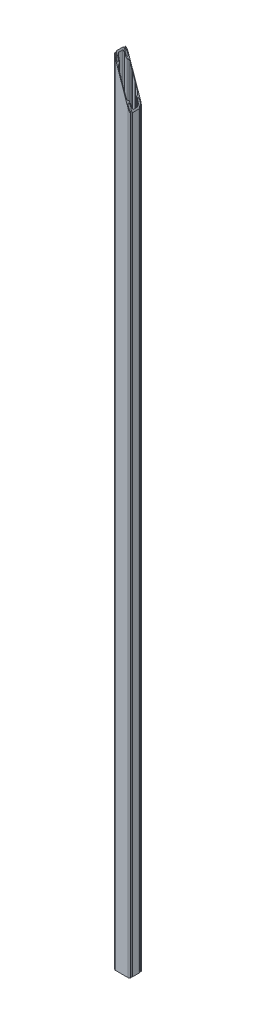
ISO-10303-21;
HEADER;
FILE_DESCRIPTION(('STEP AP214'),'2;1');
FILE_NAME('part.step','',(''),(''),'','','');
FILE_SCHEMA(('AUTOMOTIVE_DESIGN { 1 0 10303 214 1 1 1 1 }'));
ENDSEC;
DATA;
#1=APPLICATION_CONTEXT('core data for automotive mechanical design processes');
#2=APPLICATION_PROTOCOL_DEFINITION('international standard','automotive_design',2000,#1);
#3=PRODUCT_CONTEXT('',#1,'mechanical');
#4=PRODUCT('Part','Part','',(#3));
#5=PRODUCT_RELATED_PRODUCT_CATEGORY('part','',(#4));
#6=PRODUCT_DEFINITION_FORMATION('','',#4);
#7=PRODUCT_DEFINITION_CONTEXT('part definition',#1,'design');
#8=PRODUCT_DEFINITION('design','',#6,#7);
#9=PRODUCT_DEFINITION_SHAPE('','',#8);
#10=(LENGTH_UNIT() NAMED_UNIT(*) SI_UNIT(.MILLI.,.METRE.));
#11=(NAMED_UNIT(*) PLANE_ANGLE_UNIT() SI_UNIT($,.RADIAN.));
#12=(NAMED_UNIT(*) SI_UNIT($,.STERADIAN.) SOLID_ANGLE_UNIT());
#13=UNCERTAINTY_MEASURE_WITH_UNIT(LENGTH_MEASURE(1.E-05),#10,'distance_accuracy_value','');
#14=(GEOMETRIC_REPRESENTATION_CONTEXT(3) GLOBAL_UNCERTAINTY_ASSIGNED_CONTEXT((#13)) GLOBAL_UNIT_ASSIGNED_CONTEXT((#10,
#11,#12)) REPRESENTATION_CONTEXT('',''));
#15=CARTESIAN_POINT('',(0.,0.,0.));
#16=DIRECTION('',(0.,0.,1.));
#17=DIRECTION('',(1.,0.,0.));
#18=AXIS2_PLACEMENT_3D('',#15,#16,#17);
#19=CARTESIAN_POINT('',(-39.5,5000.,-17.8456725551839));
#20=DIRECTION('',(0.,-1.,0.));
#21=DIRECTION('',(0.,0.,-1.));
#22=AXIS2_PLACEMENT_3D('',#19,#20,#21);
#23=CYLINDRICAL_SURFACE('',#22,10.5);
#24=CARTESIAN_POINT('',(-39.5,4969.71200592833,-17.8456725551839));
#25=DIRECTION('',(-0.944834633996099,-0.327547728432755,0.));
#26=DIRECTION('',(0.327547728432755,-0.944834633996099,0.));
#27=AXIS2_PLACEMENT_3D('',#24,#25,#26);
#28=ELLIPSE('',#27,32.0563969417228,10.5);
#29=CARTESIAN_POINT('',(-39.5,4969.71200592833,-7.34567255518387));
#30=VERTEX_POINT('',#29);
#31=CARTESIAN_POINT('',(-29.,4939.42401185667,-17.8456725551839));
#32=VERTEX_POINT('',#31);
#33=EDGE_CURVE('E615',#30,#32,#28,.F.);
#34=ORIENTED_EDGE('',*,*,#33,.F.);
#35=DIRECTION('',(0.,-1.,0.));
#36=VECTOR('',#35,1.);
#37=CARTESIAN_POINT('',(-39.5,5000.,-7.34567255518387));
#38=LINE('',#37,#36);
#39=CARTESIAN_POINT('',(-39.5,0.,-7.34567255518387));
#40=VERTEX_POINT('',#39);
#41=EDGE_CURVE('E236',#30,#40,#38,.T.);
#42=ORIENTED_EDGE('',*,*,#41,.T.);
#43=CARTESIAN_POINT('',(-39.5,0.,-17.8456725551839));
#44=DIRECTION('',(0.,1.,0.));
#45=DIRECTION('',(0.,0.,1.));
#46=AXIS2_PLACEMENT_3D('',#43,#44,#45);
#47=CIRCLE('',#46,10.5);
#48=CARTESIAN_POINT('',(-29.,0.,-17.8456725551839));
#49=VERTEX_POINT('',#48);
#50=EDGE_CURVE('E246',#49,#40,#47,.F.);
#51=ORIENTED_EDGE('',*,*,#50,.F.);
#52=DIRECTION('',(0.,-1.,0.));
#53=VECTOR('',#52,1.);
#54=CARTESIAN_POINT('',(-29.,5000.,-17.8456725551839));
#55=LINE('',#54,#53);
#56=EDGE_CURVE('E11',#32,#49,#55,.T.);
#57=ORIENTED_EDGE('',*,*,#56,.F.);
#58=EDGE_LOOP('',(#34,#42,#51,#57));
#59=FACE_BOUND('',#58,.T.);
#60=ADVANCED_FACE('F39',(#59),#23,.T.);
#61=CARTESIAN_POINT('',(-22.5,5000.,-17.8456725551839));
#62=DIRECTION('',(0.,-1.,0.));
#63=DIRECTION('',(0.,0.,-1.));
#64=AXIS2_PLACEMENT_3D('',#61,#62,#63);
#65=CYLINDRICAL_SURFACE('',#64,6.49999999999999);
#66=DIRECTION('',(0.,-1.,0.));
#67=VECTOR('',#66,1.);
#68=CARTESIAN_POINT('',(-22.5,5000.,-24.3456725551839));
#69=LINE('',#68,#67);
#70=CARTESIAN_POINT('',(-22.5,4920.67430124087,-24.3456725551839));
#71=VERTEX_POINT('',#70);
#72=CARTESIAN_POINT('',(-22.5,0.,-24.3456725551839));
#73=VERTEX_POINT('',#72);
#74=EDGE_CURVE('E48',#71,#73,#69,.T.);
#75=ORIENTED_EDGE('',*,*,#74,.F.);
#76=CARTESIAN_POINT('',(-22.5,4920.67430124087,-17.8456725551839));
#77=DIRECTION('',(-0.944834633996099,-0.327547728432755,0.));
#78=DIRECTION('',(0.327547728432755,-0.944834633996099,0.));
#79=AXIS2_PLACEMENT_3D('',#76,#77,#78);
#80=ELLIPSE('',#79,19.8444362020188,6.49999999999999);
#81=EDGE_CURVE('E612',#71,#32,#80,.F.);
#82=ORIENTED_EDGE('',*,*,#81,.T.);
#83=ORIENTED_EDGE('',*,*,#56,.T.);
#84=CARTESIAN_POINT('',(-22.5,0.,-17.8456725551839));
#85=DIRECTION('',(0.,1.,0.));
#86=DIRECTION('',(0.,0.,1.));
#87=AXIS2_PLACEMENT_3D('',#84,#85,#86);
#88=CIRCLE('',#87,6.49999999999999);
#89=EDGE_CURVE('E431',#49,#73,#88,.F.);
#90=ORIENTED_EDGE('',*,*,#89,.T.);
#91=EDGE_LOOP('',(#75,#82,#83,#90));
#92=FACE_BOUND('',#91,.T.);
#93=ADVANCED_FACE('F851',(#92),#65,.F.);
#94=CARTESIAN_POINT('',(0.,5000.,-24.3456725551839));
#95=DIRECTION('',(0.,0.,-1.));
#96=DIRECTION('',(-1.,0.,0.));
#97=AXIS2_PLACEMENT_3D('',#94,#95,#96);
#98=PLANE('',#97);
#99=DIRECTION('',(0.,-1.,0.));
#100=VECTOR('',#99,1.);
#101=CARTESIAN_POINT('',(-12.5,5000.,-24.3456725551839));
#102=LINE('',#101,#100);
#103=CARTESIAN_POINT('',(-12.5,4891.82859260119,-24.3456725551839));
#104=VERTEX_POINT('',#103);
#105=CARTESIAN_POINT('',(-12.5,0.,-24.3456725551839));
#106=VERTEX_POINT('',#105);
#107=EDGE_CURVE('E311',#104,#106,#102,.T.);
#108=ORIENTED_EDGE('',*,*,#107,.F.);
#109=DIRECTION('',(-0.327547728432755,0.944834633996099,0.));
#110=VECTOR('',#109,1.);
#111=CARTESIAN_POINT('',(-44.6356242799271,4984.5260780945,-24.3456725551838));
#112=LINE('',#111,#110);
#113=EDGE_CURVE('E609',#104,#71,#112,.T.);
#114=ORIENTED_EDGE('',*,*,#113,.T.);
#115=ORIENTED_EDGE('',*,*,#74,.T.);
#116=DIRECTION('',(1.,0.,0.));
#117=VECTOR('',#116,1.);
#118=CARTESIAN_POINT('',(0.,0.,-24.3456725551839));
#119=LINE('',#118,#117);
#120=EDGE_CURVE('E434',#73,#106,#119,.T.);
#121=ORIENTED_EDGE('',*,*,#120,.T.);
#122=EDGE_LOOP('',(#108,#114,#115,#121));
#123=FACE_BOUND('',#122,.T.);
#124=ADVANCED_FACE('F849',(#123),#98,.F.);
#125=CARTESIAN_POINT('',(5.92283627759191,5000.,-5.9228362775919));
#126=DIRECTION('',(-0.707106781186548,0.,0.707106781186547));
#127=DIRECTION('',(0.707106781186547,0.,0.707106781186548));
#128=AXIS2_PLACEMENT_3D('',#125,#126,#127);
#129=PLANE('',#128);
#130=DIRECTION('',(0.311275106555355,-0.897895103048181,0.311275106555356));
#131=VECTOR('',#130,1.);
#132=CARTESIAN_POINT('',(-39.1630276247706,4968.73998523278,-51.0087001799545));
#133=LINE('',#132,#131);
#134=CARTESIAN_POINT('',(-11.,4887.50173630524,-22.8456725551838));
#135=VERTEX_POINT('',#134);
#136=EDGE_CURVE('E606',#104,#135,#133,.T.);
#137=ORIENTED_EDGE('',*,*,#136,.F.);
#138=ORIENTED_EDGE('',*,*,#107,.T.);
#139=DIRECTION('',(-0.707106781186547,0.,-0.707106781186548));
#140=VECTOR('',#139,1.);
#141=CARTESIAN_POINT('',(5.92283627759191,0.,-5.9228362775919));
#142=LINE('',#141,#140);
#143=CARTESIAN_POINT('',(-11.,0.,-22.8456725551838));
#144=VERTEX_POINT('',#143);
#145=EDGE_CURVE('E437',#144,#106,#142,.T.);
#146=ORIENTED_EDGE('',*,*,#145,.F.);
#147=DIRECTION('',(0.,-1.,0.));
#148=VECTOR('',#147,1.);
#149=CARTESIAN_POINT('',(-11.,5000.,-22.8456725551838));
#150=LINE('',#149,#148);
#151=EDGE_CURVE('E309',#135,#144,#150,.T.);
#152=ORIENTED_EDGE('',*,*,#151,.F.);
#153=EDGE_LOOP('',(#137,#138,#146,#152));
#154=FACE_BOUND('',#153,.T.);
#155=ADVANCED_FACE('F1018',(#154),#129,.T.);
#156=CARTESIAN_POINT('',(0.,5000.,-22.8456725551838));
#157=DIRECTION('',(0.,0.,-1.));
#158=DIRECTION('',(-1.,0.,0.));
#159=AXIS2_PLACEMENT_3D('',#156,#157,#158);
#160=PLANE('',#159);
#161=DIRECTION('',(0.,-1.,0.));
#162=VECTOR('',#161,1.);
#163=CARTESIAN_POINT('',(-8.,5000.,-22.8456725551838));
#164=LINE('',#163,#162);
#165=CARTESIAN_POINT('',(-8.,4878.84802371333,-22.8456725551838));
#166=VERTEX_POINT('',#165);
#167=CARTESIAN_POINT('',(-8.,0.,-22.8456725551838));
#168=VERTEX_POINT('',#167);
#169=EDGE_CURVE('E307',#166,#168,#164,.T.);
#170=ORIENTED_EDGE('',*,*,#169,.F.);
#171=DIRECTION('',(-0.327547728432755,0.944834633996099,0.));
#172=VECTOR('',#171,1.);
#173=CARTESIAN_POINT('',(-44.6356242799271,4984.5260780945,-22.8456725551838));
#174=LINE('',#173,#172);
#175=EDGE_CURVE('E603',#166,#135,#174,.T.);
#176=ORIENTED_EDGE('',*,*,#175,.T.);
#177=ORIENTED_EDGE('',*,*,#151,.T.);
#178=DIRECTION('',(1.,0.,0.));
#179=VECTOR('',#178,1.);
#180=CARTESIAN_POINT('',(0.,0.,-22.8456725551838));
#181=LINE('',#180,#179);
#182=EDGE_CURVE('E440',#144,#168,#181,.T.);
#183=ORIENTED_EDGE('',*,*,#182,.T.);
#184=EDGE_LOOP('',(#170,#176,#177,#183));
#185=FACE_BOUND('',#184,.T.);
#186=ADVANCED_FACE('F1014',(#185),#160,.F.);
#187=CARTESIAN_POINT('',(-15.4228362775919,5000.,-15.422836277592));
#188=DIRECTION('',(-0.707106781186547,0.,-0.707106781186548));
#189=DIRECTION('',(-0.707106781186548,0.,0.707106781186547));
#190=AXIS2_PLACEMENT_3D('',#187,#188,#189);
#191=PLANE('',#190);
#192=DIRECTION('',(0.,-1.,0.));
#193=VECTOR('',#192,1.);
#194=CARTESIAN_POINT('',(-6.50000000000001,5000.,-24.3456725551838));
#195=LINE('',#194,#193);
#196=CARTESIAN_POINT('',(-6.50000000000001,4874.52116741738,-24.3456725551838));
#197=VERTEX_POINT('',#196);
#198=CARTESIAN_POINT('',(-6.50000000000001,0.,-24.3456725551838));
#199=VERTEX_POINT('',#198);
#200=EDGE_CURVE('E305',#197,#199,#195,.T.);
#201=ORIENTED_EDGE('',*,*,#200,.F.);
#202=DIRECTION('',(-0.311275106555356,0.897895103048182,0.311275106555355));
#203=VECTOR('',#202,1.);
#204=CARTESIAN_POINT('',(-43.2994856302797,4980.6718914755,12.4538130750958));
#205=LINE('',#204,#203);
#206=EDGE_CURVE('E600',#197,#166,#205,.T.);
#207=ORIENTED_EDGE('',*,*,#206,.T.);
#208=ORIENTED_EDGE('',*,*,#169,.T.);
#209=DIRECTION('',(0.707106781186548,0.,-0.707106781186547));
#210=VECTOR('',#209,1.);
#211=CARTESIAN_POINT('',(-15.4228362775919,0.,-15.422836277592));
#212=LINE('',#211,#210);
#213=EDGE_CURVE('E443',#168,#199,#212,.T.);
#214=ORIENTED_EDGE('',*,*,#213,.T.);
#215=EDGE_LOOP('',(#201,#207,#208,#214));
#216=FACE_BOUND('',#215,.T.);
#217=ADVANCED_FACE('F1010',(#216),#191,.F.);
#218=CARTESIAN_POINT('',(0.,5000.,-24.3456725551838));
#219=DIRECTION('',(0.,0.,1.));
#220=DIRECTION('',(1.,0.,0.));
#221=AXIS2_PLACEMENT_3D('',#218,#219,#220);
#222=PLANE('',#221);
#223=DIRECTION('',(0.327547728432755,-0.944834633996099,0.));
#224=VECTOR('',#223,1.);
#225=CARTESIAN_POINT('',(-44.6356242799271,4984.5260780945,-24.3456725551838));
#226=LINE('',#225,#224);
#227=CARTESIAN_POINT('',(6.50000000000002,4837.02174618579,-24.3456725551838));
#228=VERTEX_POINT('',#227);
#229=EDGE_CURVE('E597',#197,#228,#226,.T.);
#230=ORIENTED_EDGE('',*,*,#229,.F.);
#231=ORIENTED_EDGE('',*,*,#200,.T.);
#232=DIRECTION('',(-1.,0.,0.));
#233=VECTOR('',#232,1.);
#234=CARTESIAN_POINT('',(0.,0.,-24.3456725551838));
#235=LINE('',#234,#233);
#236=CARTESIAN_POINT('',(6.50000000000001,0.,-24.3456725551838));
#237=VERTEX_POINT('',#236);
#238=EDGE_CURVE('E446',#237,#199,#235,.T.);
#239=ORIENTED_EDGE('',*,*,#238,.F.);
#240=DIRECTION('',(0.,-1.,0.));
#241=VECTOR('',#240,1.);
#242=CARTESIAN_POINT('',(6.50000000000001,5000.,-24.3456725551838));
#243=LINE('',#242,#241);
#244=EDGE_CURVE('E303',#228,#237,#243,.T.);
#245=ORIENTED_EDGE('',*,*,#244,.F.);
#246=EDGE_LOOP('',(#230,#231,#239,#245));
#247=FACE_BOUND('',#246,.T.);
#248=ADVANCED_FACE('F1006',(#247),#222,.T.);
#249=CARTESIAN_POINT('',(15.4228362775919,5000.,-15.422836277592));
#250=DIRECTION('',(-0.707106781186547,0.,0.707106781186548));
#251=DIRECTION('',(0.707106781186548,0.,0.707106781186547));
#252=AXIS2_PLACEMENT_3D('',#249,#250,#251);
#253=PLANE('',#252);
#254=DIRECTION('',(0.311275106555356,-0.897895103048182,0.311275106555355));
#255=VECTOR('',#254,1.);
#256=CARTESIAN_POINT('',(-37.3220759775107,4963.42962974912,-68.1677485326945));
#257=LINE('',#256,#255);
#258=CARTESIAN_POINT('',(8.,4832.69488988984,-22.8456725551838));
#259=VERTEX_POINT('',#258);
#260=EDGE_CURVE('E594',#228,#259,#257,.T.);
#261=ORIENTED_EDGE('',*,*,#260,.F.);
#262=ORIENTED_EDGE('',*,*,#244,.T.);
#263=DIRECTION('',(-0.707106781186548,0.,-0.707106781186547));
#264=VECTOR('',#263,1.);
#265=CARTESIAN_POINT('',(15.4228362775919,0.,-15.422836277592));
#266=LINE('',#265,#264);
#267=CARTESIAN_POINT('',(8.,0.,-22.8456725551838));
#268=VERTEX_POINT('',#267);
#269=EDGE_CURVE('E449',#268,#237,#266,.T.);
#270=ORIENTED_EDGE('',*,*,#269,.F.);
#271=DIRECTION('',(0.,-1.,0.));
#272=VECTOR('',#271,1.);
#273=CARTESIAN_POINT('',(8.,5000.,-22.8456725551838));
#274=LINE('',#273,#272);
#275=EDGE_CURVE('E301',#259,#268,#274,.T.);
#276=ORIENTED_EDGE('',*,*,#275,.F.);
#277=EDGE_LOOP('',(#261,#262,#270,#276));
#278=FACE_BOUND('',#277,.T.);
#279=ADVANCED_FACE('F1002',(#278),#253,.T.);
#280=CARTESIAN_POINT('',(0.,5000.,-22.8456725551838));
#281=DIRECTION('',(0.,0.,1.));
#282=DIRECTION('',(1.,0.,0.));
#283=AXIS2_PLACEMENT_3D('',#280,#281,#282);
#284=PLANE('',#283);
#285=DIRECTION('',(0.327547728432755,-0.944834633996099,0.));
#286=VECTOR('',#285,1.);
#287=CARTESIAN_POINT('',(-44.6356242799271,4984.5260780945,-22.8456725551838));
#288=LINE('',#287,#286);
#289=CARTESIAN_POINT('',(11.,4824.04117729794,-22.8456725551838));
#290=VERTEX_POINT('',#289);
#291=EDGE_CURVE('E591',#259,#290,#288,.T.);
#292=ORIENTED_EDGE('',*,*,#291,.F.);
#293=ORIENTED_EDGE('',*,*,#275,.T.);
#294=DIRECTION('',(-1.,0.,0.));
#295=VECTOR('',#294,1.);
#296=CARTESIAN_POINT('',(0.,0.,-22.8456725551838));
#297=LINE('',#296,#295);
#298=CARTESIAN_POINT('',(11.,0.,-22.8456725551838));
#299=VERTEX_POINT('',#298);
#300=EDGE_CURVE('E452',#299,#268,#297,.T.);
#301=ORIENTED_EDGE('',*,*,#300,.F.);
#302=DIRECTION('',(0.,-1.,0.));
#303=VECTOR('',#302,1.);
#304=CARTESIAN_POINT('',(11.,5000.,-22.8456725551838));
#305=LINE('',#304,#303);
#306=EDGE_CURVE('E299',#290,#299,#305,.T.);
#307=ORIENTED_EDGE('',*,*,#306,.F.);
#308=EDGE_LOOP('',(#292,#293,#301,#307));
#309=FACE_BOUND('',#308,.T.);
#310=ADVANCED_FACE('F998',(#309),#284,.T.);
#311=CARTESIAN_POINT('',(-5.92283627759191,5000.,-5.9228362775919));
#312=DIRECTION('',(-0.707106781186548,0.,-0.707106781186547));
#313=DIRECTION('',(-0.707106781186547,0.,0.707106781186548));
#314=AXIS2_PLACEMENT_3D('',#311,#312,#313);
#315=PLANE('',#314);
#316=DIRECTION('',(0.,-1.,0.));
#317=VECTOR('',#316,1.);
#318=CARTESIAN_POINT('',(12.5,5000.,-24.3456725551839));
#319=LINE('',#318,#317);
#320=CARTESIAN_POINT('',(12.5,4819.71432100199,-24.3456725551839));
#321=VERTEX_POINT('',#320);
#322=CARTESIAN_POINT('',(12.5,0.,-24.3456725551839));
#323=VERTEX_POINT('',#322);
#324=EDGE_CURVE('E297',#321,#323,#319,.T.);
#325=ORIENTED_EDGE('',*,*,#324,.F.);
#326=DIRECTION('',(-0.311275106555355,0.897895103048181,0.311275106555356));
#327=VECTOR('',#326,1.);
#328=CARTESIAN_POINT('',(-41.4585339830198,4975.36153599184,29.6128614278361));
#329=LINE('',#328,#327);
#330=EDGE_CURVE('E588',#321,#290,#329,.T.);
#331=ORIENTED_EDGE('',*,*,#330,.T.);
#332=ORIENTED_EDGE('',*,*,#306,.T.);
#333=DIRECTION('',(0.707106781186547,0.,-0.707106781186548));
#334=VECTOR('',#333,1.);
#335=CARTESIAN_POINT('',(-5.92283627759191,0.,-5.9228362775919));
#336=LINE('',#335,#334);
#337=EDGE_CURVE('E455',#299,#323,#336,.T.);
#338=ORIENTED_EDGE('',*,*,#337,.T.);
#339=EDGE_LOOP('',(#325,#331,#332,#338));
#340=FACE_BOUND('',#339,.T.);
#341=ADVANCED_FACE('F994',(#340),#315,.F.);
#342=CARTESIAN_POINT('',(0.,5000.,-24.3456725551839));
#343=DIRECTION('',(0.,0.,1.));
#344=DIRECTION('',(1.,0.,0.));
#345=AXIS2_PLACEMENT_3D('',#342,#343,#344);
#346=PLANE('',#345);
#347=DIRECTION('',(0.327547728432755,-0.944834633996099,0.));
#348=VECTOR('',#347,1.);
#349=CARTESIAN_POINT('',(-44.6356242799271,4984.5260780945,-24.3456725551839));
#350=LINE('',#349,#348);
#351=CARTESIAN_POINT('',(22.5,4790.8686123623,-24.3456725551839));
#352=VERTEX_POINT('',#351);
#353=EDGE_CURVE('E585',#321,#352,#350,.T.);
#354=ORIENTED_EDGE('',*,*,#353,.F.);
#355=ORIENTED_EDGE('',*,*,#324,.T.);
#356=DIRECTION('',(-1.,0.,0.));
#357=VECTOR('',#356,1.);
#358=CARTESIAN_POINT('',(0.,0.,-24.3456725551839));
#359=LINE('',#358,#357);
#360=CARTESIAN_POINT('',(22.5,0.,-24.3456725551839));
#361=VERTEX_POINT('',#360);
#362=EDGE_CURVE('E458',#361,#323,#359,.T.);
#363=ORIENTED_EDGE('',*,*,#362,.F.);
#364=DIRECTION('',(0.,-1.,0.));
#365=VECTOR('',#364,1.);
#366=CARTESIAN_POINT('',(22.5,5000.,-24.3456725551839));
#367=LINE('',#366,#365);
#368=EDGE_CURVE('E295',#352,#361,#367,.T.);
#369=ORIENTED_EDGE('',*,*,#368,.F.);
#370=EDGE_LOOP('',(#354,#355,#363,#369));
#371=FACE_BOUND('',#370,.T.);
#372=ADVANCED_FACE('F990',(#371),#346,.T.);
#373=CARTESIAN_POINT('',(22.5,5000.,-17.8456725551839));
#374=DIRECTION('',(0.,-1.,0.));
#375=DIRECTION('',(0.,0.,-1.));
#376=AXIS2_PLACEMENT_3D('',#373,#374,#375);
#377=CYLINDRICAL_SURFACE('',#376,6.49999999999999);
#378=CARTESIAN_POINT('',(22.5,4790.8686123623,-17.8456725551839));
#379=DIRECTION('',(-0.944834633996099,-0.327547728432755,0.));
#380=DIRECTION('',(0.327547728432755,-0.944834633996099,0.));
#381=AXIS2_PLACEMENT_3D('',#378,#379,#380);
#382=ELLIPSE('',#381,19.8444362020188,6.49999999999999);
#383=CARTESIAN_POINT('',(29.,4772.11890174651,-17.8456725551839));
#384=VERTEX_POINT('',#383);
#385=EDGE_CURVE('E582',#352,#384,#382,.T.);
#386=ORIENTED_EDGE('',*,*,#385,.F.);
#387=ORIENTED_EDGE('',*,*,#368,.T.);
#388=CARTESIAN_POINT('',(22.5,0.,-17.8456725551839));
#389=DIRECTION('',(0.,1.,0.));
#390=DIRECTION('',(0.,0.,1.));
#391=AXIS2_PLACEMENT_3D('',#388,#389,#390);
#392=CIRCLE('',#391,6.49999999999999);
#393=CARTESIAN_POINT('',(29.,0.,-17.8456725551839));
#394=VERTEX_POINT('',#393);
#395=EDGE_CURVE('E461',#394,#361,#392,.T.);
#396=ORIENTED_EDGE('',*,*,#395,.F.);
#397=DIRECTION('',(0.,-1.,0.));
#398=VECTOR('',#397,1.);
#399=CARTESIAN_POINT('',(29.,5000.,-17.8456725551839));
#400=LINE('',#399,#398);
#401=EDGE_CURVE('E293',#384,#394,#400,.T.);
#402=ORIENTED_EDGE('',*,*,#401,.F.);
#403=EDGE_LOOP('',(#386,#387,#396,#402));
#404=FACE_BOUND('',#403,.T.);
#405=ADVANCED_FACE('F986',(#404),#377,.F.);
#406=CARTESIAN_POINT('',(39.5,5000.,-17.8456725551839));
#407=DIRECTION('',(0.,-1.,0.));
#408=DIRECTION('',(0.,0.,-1.));
#409=AXIS2_PLACEMENT_3D('',#406,#407,#408);
#410=CYLINDRICAL_SURFACE('',#409,10.5);
#411=DIRECTION('',(0.,-1.,0.));
#412=VECTOR('',#411,1.);
#413=CARTESIAN_POINT('',(39.5,5000.,-7.34567255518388));
#414=LINE('',#413,#412);
#415=CARTESIAN_POINT('',(39.5,4741.83090767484,-7.34567255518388));
#416=VERTEX_POINT('',#415);
#417=CARTESIAN_POINT('',(39.5,0.,-7.34567255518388));
#418=VERTEX_POINT('',#417);
#419=EDGE_CURVE('E291',#416,#418,#414,.T.);
#420=ORIENTED_EDGE('',*,*,#419,.F.);
#421=CARTESIAN_POINT('',(39.5,4741.83090767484,-17.8456725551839));
#422=DIRECTION('',(-0.944834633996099,-0.327547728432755,0.));
#423=DIRECTION('',(0.327547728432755,-0.944834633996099,0.));
#424=AXIS2_PLACEMENT_3D('',#421,#422,#423);
#425=ELLIPSE('',#424,32.0563969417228,10.5);
#426=EDGE_CURVE('E579',#416,#384,#425,.T.);
#427=ORIENTED_EDGE('',*,*,#426,.T.);
#428=ORIENTED_EDGE('',*,*,#401,.T.);
#429=CARTESIAN_POINT('',(39.5,0.,-17.8456725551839));
#430=DIRECTION('',(0.,1.,0.));
#431=DIRECTION('',(0.,0.,1.));
#432=AXIS2_PLACEMENT_3D('',#429,#430,#431);
#433=CIRCLE('',#432,10.5);
#434=EDGE_CURVE('E464',#394,#418,#433,.T.);
#435=ORIENTED_EDGE('',*,*,#434,.T.);
#436=EDGE_LOOP('',(#420,#427,#428,#435));
#437=FACE_BOUND('',#436,.T.);
#438=ADVANCED_FACE('F982',(#437),#410,.T.);
#439=CARTESIAN_POINT('',(39.5,5000.,-0.845672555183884));
#440=DIRECTION('',(0.,-1.,0.));
#441=DIRECTION('',(0.,0.,-1.));
#442=AXIS2_PLACEMENT_3D('',#439,#440,#441);
#443=CYLINDRICAL_SURFACE('',#442,6.49999999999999);
#444=CARTESIAN_POINT('',(39.5,4741.83090767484,-0.845672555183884));
#445=DIRECTION('',(-0.944834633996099,-0.327547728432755,0.));
#446=DIRECTION('',(0.327547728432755,-0.944834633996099,0.));
#447=AXIS2_PLACEMENT_3D('',#444,#445,#446);
#448=ELLIPSE('',#447,19.8444362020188,6.49999999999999);
#449=CARTESIAN_POINT('',(46.,4723.08119705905,-0.845672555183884));
#450=VERTEX_POINT('',#449);
#451=EDGE_CURVE('E576',#416,#450,#448,.T.);
#452=ORIENTED_EDGE('',*,*,#451,.F.);
#453=ORIENTED_EDGE('',*,*,#419,.T.);
#454=CARTESIAN_POINT('',(39.5,0.,-0.845672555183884));
#455=DIRECTION('',(0.,1.,0.));
#456=DIRECTION('',(0.,0.,1.));
#457=AXIS2_PLACEMENT_3D('',#454,#455,#456);
#458=CIRCLE('',#457,6.49999999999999);
#459=CARTESIAN_POINT('',(46.,0.,-0.845672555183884));
#460=VERTEX_POINT('',#459);
#461=EDGE_CURVE('E467',#460,#418,#458,.T.);
#462=ORIENTED_EDGE('',*,*,#461,.F.);
#463=DIRECTION('',(0.,-1.,0.));
#464=VECTOR('',#463,1.);
#465=CARTESIAN_POINT('',(46.,5000.,-0.845672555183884));
#466=LINE('',#465,#464);
#467=EDGE_CURVE('E289',#450,#460,#466,.T.);
#468=ORIENTED_EDGE('',*,*,#467,.F.);
#469=EDGE_LOOP('',(#452,#453,#462,#468));
#470=FACE_BOUND('',#469,.T.);
#471=ADVANCED_FACE('F978',(#470),#443,.F.);
#472=CARTESIAN_POINT('',(46.,5000.,0.));
#473=DIRECTION('',(-1.,0.,0.));
#474=DIRECTION('',(0.,0.,1.));
#475=AXIS2_PLACEMENT_3D('',#472,#473,#474);
#476=PLANE('',#475);
#477=DIRECTION('',(0.,0.,1.));
#478=VECTOR('',#477,1.);
#479=CARTESIAN_POINT('',(46.,4723.08119705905,0.));
#480=LINE('',#479,#478);
#481=CARTESIAN_POINT('',(46.,4723.08119705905,24.1543274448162));
#482=VERTEX_POINT('',#481);
#483=EDGE_CURVE('E573',#450,#482,#480,.T.);
#484=ORIENTED_EDGE('',*,*,#483,.F.);
#485=ORIENTED_EDGE('',*,*,#467,.T.);
#486=DIRECTION('',(0.,0.,-1.));
#487=VECTOR('',#486,1.);
#488=CARTESIAN_POINT('',(46.,0.,0.));
#489=LINE('',#488,#487);
#490=CARTESIAN_POINT('',(46.,0.,24.1543274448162));
#491=VERTEX_POINT('',#490);
#492=EDGE_CURVE('E470',#491,#460,#489,.T.);
#493=ORIENTED_EDGE('',*,*,#492,.F.);
#494=DIRECTION('',(0.,-1.,0.));
#495=VECTOR('',#494,1.);
#496=CARTESIAN_POINT('',(46.,5000.,24.1543274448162));
#497=LINE('',#496,#495);
#498=EDGE_CURVE('E287',#482,#491,#497,.T.);
#499=ORIENTED_EDGE('',*,*,#498,.F.);
#500=EDGE_LOOP('',(#484,#485,#493,#499));
#501=FACE_BOUND('',#500,.T.);
#502=ADVANCED_FACE('F974',(#501),#476,.T.);
#503=CARTESIAN_POINT('',(39.5,5000.,24.1543274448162));
#504=DIRECTION('',(0.,-1.,0.));
#505=DIRECTION('',(0.,0.,-1.));
#506=AXIS2_PLACEMENT_3D('',#503,#504,#505);
#507=CYLINDRICAL_SURFACE('',#506,6.49999999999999);
#508=DIRECTION('',(0.,-1.,0.));
#509=VECTOR('',#508,1.);
#510=CARTESIAN_POINT('',(39.5,5000.,30.6543274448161));
#511=LINE('',#510,#509);
#512=CARTESIAN_POINT('',(39.5,4741.83090767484,30.6543274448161));
#513=VERTEX_POINT('',#512);
#514=CARTESIAN_POINT('',(39.5,0.,30.6543274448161));
#515=VERTEX_POINT('',#514);
#516=EDGE_CURVE('E285',#513,#515,#511,.T.);
#517=ORIENTED_EDGE('',*,*,#516,.F.);
#518=CARTESIAN_POINT('',(39.5,4741.83090767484,24.1543274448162));
#519=DIRECTION('',(-0.944834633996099,-0.327547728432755,0.));
#520=DIRECTION('',(0.327547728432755,-0.944834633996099,0.));
#521=AXIS2_PLACEMENT_3D('',#518,#519,#520);
#522=ELLIPSE('',#521,19.8444362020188,6.49999999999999);
#523=EDGE_CURVE('E570',#513,#482,#522,.F.);
#524=ORIENTED_EDGE('',*,*,#523,.T.);
#525=ORIENTED_EDGE('',*,*,#498,.T.);
#526=CARTESIAN_POINT('',(39.5,0.,24.1543274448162));
#527=DIRECTION('',(0.,1.,0.));
#528=DIRECTION('',(0.,0.,1.));
#529=AXIS2_PLACEMENT_3D('',#526,#527,#528);
#530=CIRCLE('',#529,6.49999999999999);
#531=EDGE_CURVE('E473',#491,#515,#530,.F.);
#532=ORIENTED_EDGE('',*,*,#531,.T.);
#533=EDGE_LOOP('',(#517,#524,#525,#532));
#534=FACE_BOUND('',#533,.T.);
#535=ADVANCED_FACE('F970',(#534),#507,.F.);
#536=CARTESIAN_POINT('',(39.5,5000.,41.1543274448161));
#537=DIRECTION('',(0.,-1.,0.));
#538=DIRECTION('',(0.,0.,-1.));
#539=AXIS2_PLACEMENT_3D('',#536,#537,#538);
#540=CYLINDRICAL_SURFACE('',#539,10.5);
#541=CARTESIAN_POINT('',(39.5,4741.83090767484,41.1543274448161));
#542=DIRECTION('',(-0.944834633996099,-0.327547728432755,0.));
#543=DIRECTION('',(0.327547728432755,-0.944834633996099,0.));
#544=AXIS2_PLACEMENT_3D('',#541,#542,#543);
#545=ELLIPSE('',#544,32.0563969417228,10.5);
#546=CARTESIAN_POINT('',(29.,4772.11890174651,41.1543274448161));
#547=VERTEX_POINT('',#546);
#548=EDGE_CURVE('E567',#513,#547,#545,.F.);
#549=ORIENTED_EDGE('',*,*,#548,.F.);
#550=ORIENTED_EDGE('',*,*,#516,.T.);
#551=CARTESIAN_POINT('',(39.5,0.,41.1543274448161));
#552=DIRECTION('',(0.,1.,0.));
#553=DIRECTION('',(0.,0.,1.));
#554=AXIS2_PLACEMENT_3D('',#551,#552,#553);
#555=CIRCLE('',#554,10.5);
#556=CARTESIAN_POINT('',(29.,0.,41.1543274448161));
#557=VERTEX_POINT('',#556);
#558=EDGE_CURVE('E476',#557,#515,#555,.F.);
#559=ORIENTED_EDGE('',*,*,#558,.F.);
#560=DIRECTION('',(0.,-1.,0.));
#561=VECTOR('',#560,1.);
#562=CARTESIAN_POINT('',(29.,5000.,41.1543274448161));
#563=LINE('',#562,#561);
#564=EDGE_CURVE('E283',#547,#557,#563,.T.);
#565=ORIENTED_EDGE('',*,*,#564,.F.);
#566=EDGE_LOOP('',(#549,#550,#559,#565));
#567=FACE_BOUND('',#566,.T.);
#568=ADVANCED_FACE('F966',(#567),#540,.T.);
#569=CARTESIAN_POINT('',(22.5,5000.,41.1543274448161));
#570=DIRECTION('',(0.,-1.,0.));
#571=DIRECTION('',(0.,0.,-1.));
#572=AXIS2_PLACEMENT_3D('',#569,#570,#571);
#573=CYLINDRICAL_SURFACE('',#572,6.5);
#574=DIRECTION('',(0.,-1.,0.));
#575=VECTOR('',#574,1.);
#576=CARTESIAN_POINT('',(22.5,5000.,47.6543274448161));
#577=LINE('',#576,#575);
#578=CARTESIAN_POINT('',(22.5,4790.8686123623,47.6543274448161));
#579=VERTEX_POINT('',#578);
#580=CARTESIAN_POINT('',(22.5,0.,47.6543274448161));
#581=VERTEX_POINT('',#580);
#582=EDGE_CURVE('E281',#579,#581,#577,.T.);
#583=ORIENTED_EDGE('',*,*,#582,.F.);
#584=CARTESIAN_POINT('',(22.5,4790.8686123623,41.1543274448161));
#585=DIRECTION('',(-0.944834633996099,-0.327547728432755,0.));
#586=DIRECTION('',(0.327547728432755,-0.944834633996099,0.));
#587=AXIS2_PLACEMENT_3D('',#584,#585,#586);
#588=ELLIPSE('',#587,19.8444362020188,6.5);
#589=EDGE_CURVE('E564',#579,#547,#588,.F.);
#590=ORIENTED_EDGE('',*,*,#589,.T.);
#591=ORIENTED_EDGE('',*,*,#564,.T.);
#592=CARTESIAN_POINT('',(22.5,0.,41.1543274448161));
#593=DIRECTION('',(0.,1.,0.));
#594=DIRECTION('',(0.,0.,1.));
#595=AXIS2_PLACEMENT_3D('',#592,#593,#594);
#596=CIRCLE('',#595,6.5);
#597=EDGE_CURVE('E479',#557,#581,#596,.F.);
#598=ORIENTED_EDGE('',*,*,#597,.T.);
#599=EDGE_LOOP('',(#583,#590,#591,#598));
#600=FACE_BOUND('',#599,.T.);
#601=ADVANCED_FACE('F962',(#600),#573,.F.);
#602=CARTESIAN_POINT('',(0.,5000.,47.6543274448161));
#603=DIRECTION('',(0.,0.,-1.));
#604=DIRECTION('',(-1.,0.,0.));
#605=AXIS2_PLACEMENT_3D('',#602,#603,#604);
#606=PLANE('',#605);
#607=DIRECTION('',(-0.327547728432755,0.944834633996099,0.));
#608=VECTOR('',#607,1.);
#609=CARTESIAN_POINT('',(-44.6356242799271,4984.5260780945,47.6543274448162));
#610=LINE('',#609,#608);
#611=CARTESIAN_POINT('',(12.5,4819.71432100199,47.6543274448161));
#612=VERTEX_POINT('',#611);
#613=EDGE_CURVE('E561',#579,#612,#610,.T.);
#614=ORIENTED_EDGE('',*,*,#613,.F.);
#615=ORIENTED_EDGE('',*,*,#582,.T.);
#616=DIRECTION('',(1.,0.,0.));
#617=VECTOR('',#616,1.);
#618=CARTESIAN_POINT('',(0.,0.,47.6543274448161));
#619=LINE('',#618,#617);
#620=CARTESIAN_POINT('',(12.5,0.,47.6543274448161));
#621=VERTEX_POINT('',#620);
#622=EDGE_CURVE('E482',#621,#581,#619,.T.);
#623=ORIENTED_EDGE('',*,*,#622,.F.);
#624=DIRECTION('',(0.,-1.,0.));
#625=VECTOR('',#624,1.);
#626=CARTESIAN_POINT('',(12.5,5000.,47.6543274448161));
#627=LINE('',#626,#625);
#628=EDGE_CURVE('E279',#612,#621,#627,.T.);
#629=ORIENTED_EDGE('',*,*,#628,.F.);
#630=EDGE_LOOP('',(#614,#615,#623,#629));
#631=FACE_BOUND('',#630,.T.);
#632=ADVANCED_FACE('F958',(#631),#606,.T.);
#633=CARTESIAN_POINT('',(-17.577163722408,5000.,17.577163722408));
#634=DIRECTION('',(0.707106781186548,0.,-0.707106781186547));
#635=DIRECTION('',(-0.707106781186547,0.,-0.707106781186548));
#636=AXIS2_PLACEMENT_3D('',#633,#634,#635);
#637=PLANE('',#636);
#638=DIRECTION('',(-0.311275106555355,0.897895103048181,-0.311275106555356));
#639=VECTOR('',#638,1.);
#640=CARTESIAN_POINT('',(-43.7169606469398,4981.876127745,-8.56263320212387));
#641=LINE('',#640,#639);
#642=CARTESIAN_POINT('',(11.,4824.04117729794,46.1543274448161));
#643=VERTEX_POINT('',#642);
#644=EDGE_CURVE('E558',#612,#643,#641,.T.);
#645=ORIENTED_EDGE('',*,*,#644,.F.);
#646=ORIENTED_EDGE('',*,*,#628,.T.);
#647=DIRECTION('',(0.707106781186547,0.,0.707106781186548));
#648=VECTOR('',#647,1.);
#649=CARTESIAN_POINT('',(-17.577163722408,0.,17.577163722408));
#650=LINE('',#649,#648);
#651=CARTESIAN_POINT('',(11.,0.,46.1543274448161));
#652=VERTEX_POINT('',#651);
#653=EDGE_CURVE('E485',#652,#621,#650,.T.);
#654=ORIENTED_EDGE('',*,*,#653,.F.);
#655=DIRECTION('',(0.,-1.,0.));
#656=VECTOR('',#655,1.);
#657=CARTESIAN_POINT('',(11.,5000.,46.1543274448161));
#658=LINE('',#657,#656);
#659=EDGE_CURVE('E277',#643,#652,#658,.T.);
#660=ORIENTED_EDGE('',*,*,#659,.F.);
#661=EDGE_LOOP('',(#645,#646,#654,#660));
#662=FACE_BOUND('',#661,.T.);
#663=ADVANCED_FACE('F954',(#662),#637,.T.);
#664=CARTESIAN_POINT('',(0.,5000.,46.1543274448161));
#665=DIRECTION('',(0.,0.,1.));
#666=DIRECTION('',(1.,0.,0.));
#667=AXIS2_PLACEMENT_3D('',#664,#665,#666);
#668=PLANE('',#667);
#669=DIRECTION('',(0.,-1.,0.));
#670=VECTOR('',#669,1.);
#671=CARTESIAN_POINT('',(8.,5000.,46.1543274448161));
#672=LINE('',#671,#670);
#673=CARTESIAN_POINT('',(8.,4832.69488988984,46.1543274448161));
#674=VERTEX_POINT('',#673);
#675=CARTESIAN_POINT('',(8.,0.,46.1543274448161));
#676=VERTEX_POINT('',#675);
#677=EDGE_CURVE('E275',#674,#676,#672,.T.);
#678=ORIENTED_EDGE('',*,*,#677,.F.);
#679=DIRECTION('',(0.327547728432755,-0.944834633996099,0.));
#680=VECTOR('',#679,1.);
#681=CARTESIAN_POINT('',(-44.6356242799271,4984.5260780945,46.1543274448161));
#682=LINE('',#681,#680);
#683=EDGE_CURVE('E555',#674,#643,#682,.T.);
#684=ORIENTED_EDGE('',*,*,#683,.T.);
#685=ORIENTED_EDGE('',*,*,#659,.T.);
#686=DIRECTION('',(-1.,0.,0.));
#687=VECTOR('',#686,1.);
#688=CARTESIAN_POINT('',(0.,0.,46.1543274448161));
#689=LINE('',#688,#687);
#690=EDGE_CURVE('E488',#652,#676,#689,.T.);
#691=ORIENTED_EDGE('',*,*,#690,.T.);
#692=EDGE_LOOP('',(#678,#684,#685,#691));
#693=FACE_BOUND('',#692,.T.);
#694=ADVANCED_FACE('F950',(#693),#668,.F.);
#695=CARTESIAN_POINT('',(27.077163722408,5000.,27.0771637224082));
#696=DIRECTION('',(0.707106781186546,0.,0.707106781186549));
#697=DIRECTION('',(0.707106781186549,0.,-0.707106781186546));
#698=AXIS2_PLACEMENT_3D('',#695,#696,#697);
#699=PLANE('',#698);
#700=DIRECTION('',(0.,-1.,0.));
#701=VECTOR('',#700,1.);
#702=CARTESIAN_POINT('',(6.50000000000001,5000.,47.6543274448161));
#703=LINE('',#702,#701);
#704=CARTESIAN_POINT('',(6.50000000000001,4837.0217461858,47.6543274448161));
#705=VERTEX_POINT('',#704);
#706=CARTESIAN_POINT('',(6.50000000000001,0.,47.6543274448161));
#707=VERTEX_POINT('',#706);
#708=EDGE_CURVE('E273',#705,#707,#703,.T.);
#709=ORIENTED_EDGE('',*,*,#708,.F.);
#710=DIRECTION('',(0.311275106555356,-0.897895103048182,-0.311275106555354));
#711=VECTOR('',#710,1.);
#712=CARTESIAN_POINT('',(-35.0636493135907,4956.91503799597,89.2179767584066));
#713=LINE('',#712,#711);
#714=EDGE_CURVE('E552',#705,#674,#713,.T.);
#715=ORIENTED_EDGE('',*,*,#714,.T.);
#716=ORIENTED_EDGE('',*,*,#677,.T.);
#717=DIRECTION('',(-0.707106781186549,0.,0.707106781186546));
#718=VECTOR('',#717,1.);
#719=CARTESIAN_POINT('',(27.077163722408,0.,27.0771637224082));
#720=LINE('',#719,#718);
#721=EDGE_CURVE('E491',#676,#707,#720,.T.);
#722=ORIENTED_EDGE('',*,*,#721,.T.);
#723=EDGE_LOOP('',(#709,#715,#716,#722));
#724=FACE_BOUND('',#723,.T.);
#725=ADVANCED_FACE('F946',(#724),#699,.F.);
#726=CARTESIAN_POINT('',(0.,5000.,47.6543274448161));
#727=DIRECTION('',(0.,0.,-1.));
#728=DIRECTION('',(-1.,0.,0.));
#729=AXIS2_PLACEMENT_3D('',#726,#727,#728);
#730=PLANE('',#729);
#731=DIRECTION('',(-0.327547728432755,0.944834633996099,0.));
#732=VECTOR('',#731,1.);
#733=CARTESIAN_POINT('',(-44.6356242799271,4984.5260780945,47.6543274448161));
#734=LINE('',#733,#732);
#735=CARTESIAN_POINT('',(-6.50000000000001,4874.52116741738,47.6543274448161));
#736=VERTEX_POINT('',#735);
#737=EDGE_CURVE('E549',#705,#736,#734,.T.);
#738=ORIENTED_EDGE('',*,*,#737,.F.);
#739=ORIENTED_EDGE('',*,*,#708,.T.);
#740=DIRECTION('',(1.,0.,0.));
#741=VECTOR('',#740,1.);
#742=CARTESIAN_POINT('',(0.,0.,47.6543274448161));
#743=LINE('',#742,#741);
#744=CARTESIAN_POINT('',(-6.50000000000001,0.,47.6543274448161));
#745=VERTEX_POINT('',#744);
#746=EDGE_CURVE('E494',#745,#707,#743,.T.);
#747=ORIENTED_EDGE('',*,*,#746,.F.);
#748=DIRECTION('',(0.,-1.,0.));
#749=VECTOR('',#748,1.);
#750=CARTESIAN_POINT('',(-6.50000000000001,5000.,47.6543274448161));
#751=LINE('',#750,#749);
#752=EDGE_CURVE('E271',#736,#745,#751,.T.);
#753=ORIENTED_EDGE('',*,*,#752,.F.);
#754=EDGE_LOOP('',(#738,#739,#747,#753));
#755=FACE_BOUND('',#754,.T.);
#756=ADVANCED_FACE('F942',(#755),#730,.T.);
#757=CARTESIAN_POINT('',(-27.077163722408,5000.,27.0771637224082));
#758=DIRECTION('',(0.707106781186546,0.,-0.707106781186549));
#759=DIRECTION('',(-0.707106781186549,0.,-0.707106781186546));
#760=AXIS2_PLACEMENT_3D('',#757,#758,#759);
#761=PLANE('',#760);
#762=DIRECTION('',(-0.311275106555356,0.897895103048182,-0.311275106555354));
#763=VECTOR('',#762,1.);
#764=CARTESIAN_POINT('',(-45.5579122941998,4987.18648322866,8.59641515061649));
#765=LINE('',#764,#763);
#766=CARTESIAN_POINT('',(-7.99999999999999,4878.84802371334,46.1543274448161));
#767=VERTEX_POINT('',#766);
#768=EDGE_CURVE('E546',#736,#767,#765,.T.);
#769=ORIENTED_EDGE('',*,*,#768,.F.);
#770=ORIENTED_EDGE('',*,*,#752,.T.);
#771=DIRECTION('',(0.707106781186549,0.,0.707106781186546));
#772=VECTOR('',#771,1.);
#773=CARTESIAN_POINT('',(-27.077163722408,0.,27.0771637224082));
#774=LINE('',#773,#772);
#775=CARTESIAN_POINT('',(-8.,0.,46.1543274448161));
#776=VERTEX_POINT('',#775);
#777=EDGE_CURVE('E497',#776,#745,#774,.T.);
#778=ORIENTED_EDGE('',*,*,#777,.F.);
#779=DIRECTION('',(0.,-1.,0.));
#780=VECTOR('',#779,1.);
#781=CARTESIAN_POINT('',(-8.,5000.,46.1543274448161));
#782=LINE('',#781,#780);
#783=EDGE_CURVE('E269',#767,#776,#782,.T.);
#784=ORIENTED_EDGE('',*,*,#783,.F.);
#785=EDGE_LOOP('',(#769,#770,#778,#784));
#786=FACE_BOUND('',#785,.T.);
#787=ADVANCED_FACE('F938',(#786),#761,.T.);
#788=CARTESIAN_POINT('',(0.,5000.,46.1543274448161));
#789=DIRECTION('',(0.,0.,-1.));
#790=DIRECTION('',(-1.,0.,0.));
#791=AXIS2_PLACEMENT_3D('',#788,#789,#790);
#792=PLANE('',#791);
#793=DIRECTION('',(-0.327547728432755,0.944834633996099,0.));
#794=VECTOR('',#793,1.);
#795=CARTESIAN_POINT('',(-44.6356242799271,4984.5260780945,46.1543274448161));
#796=LINE('',#795,#794);
#797=CARTESIAN_POINT('',(-11.,4887.50173630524,46.1543274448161));
#798=VERTEX_POINT('',#797);
#799=EDGE_CURVE('E543',#767,#798,#796,.T.);
#800=ORIENTED_EDGE('',*,*,#799,.F.);
#801=ORIENTED_EDGE('',*,*,#783,.T.);
#802=DIRECTION('',(1.,0.,0.));
#803=VECTOR('',#802,1.);
#804=CARTESIAN_POINT('',(0.,0.,46.1543274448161));
#805=LINE('',#804,#803);
#806=CARTESIAN_POINT('',(-11.,0.,46.1543274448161));
#807=VERTEX_POINT('',#806);
#808=EDGE_CURVE('E500',#807,#776,#805,.T.);
#809=ORIENTED_EDGE('',*,*,#808,.F.);
#810=DIRECTION('',(0.,-1.,0.));
#811=VECTOR('',#810,1.);
#812=CARTESIAN_POINT('',(-11.,5000.,46.1543274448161));
#813=LINE('',#812,#811);
#814=EDGE_CURVE('E267',#798,#807,#813,.T.);
#815=ORIENTED_EDGE('',*,*,#814,.F.);
#816=EDGE_LOOP('',(#800,#801,#809,#815));
#817=FACE_BOUND('',#816,.T.);
#818=ADVANCED_FACE('F934',(#817),#792,.T.);
#819=CARTESIAN_POINT('',(17.577163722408,5000.,17.577163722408));
#820=DIRECTION('',(0.707106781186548,0.,0.707106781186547));
#821=DIRECTION('',(0.707106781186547,0.,-0.707106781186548));
#822=AXIS2_PLACEMENT_3D('',#819,#820,#821);
#823=PLANE('',#822);
#824=DIRECTION('',(0.,-1.,0.));
#825=VECTOR('',#824,1.);
#826=CARTESIAN_POINT('',(-12.5,5000.,47.6543274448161));
#827=LINE('',#826,#825);
#828=CARTESIAN_POINT('',(-12.5,4891.82859260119,47.6543274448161));
#829=VERTEX_POINT('',#828);
#830=CARTESIAN_POINT('',(-12.5,0.,47.6543274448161));
#831=VERTEX_POINT('',#830);
#832=EDGE_CURVE('E265',#829,#831,#827,.T.);
#833=ORIENTED_EDGE('',*,*,#832,.F.);
#834=DIRECTION('',(0.311275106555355,-0.897895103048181,-0.311275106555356));
#835=VECTOR('',#834,1.);
#836=CARTESIAN_POINT('',(-36.9046009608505,4962.22539347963,72.0589284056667));
#837=LINE('',#836,#835);
#838=EDGE_CURVE('E540',#829,#798,#837,.T.);
#839=ORIENTED_EDGE('',*,*,#838,.T.);
#840=ORIENTED_EDGE('',*,*,#814,.T.);
#841=DIRECTION('',(-0.707106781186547,0.,0.707106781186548));
#842=VECTOR('',#841,1.);
#843=CARTESIAN_POINT('',(17.577163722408,0.,17.577163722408));
#844=LINE('',#843,#842);
#845=EDGE_CURVE('E503',#807,#831,#844,.T.);
#846=ORIENTED_EDGE('',*,*,#845,.T.);
#847=EDGE_LOOP('',(#833,#839,#840,#846));
#848=FACE_BOUND('',#847,.T.);
#849=ADVANCED_FACE('F930',(#848),#823,.F.);
#850=CARTESIAN_POINT('',(0.,5000.,47.6543274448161));
#851=DIRECTION('',(0.,0.,-1.));
#852=DIRECTION('',(-1.,0.,0.));
#853=AXIS2_PLACEMENT_3D('',#850,#851,#852);
#854=PLANE('',#853);
#855=DIRECTION('',(-0.327547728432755,0.944834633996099,0.));
#856=VECTOR('',#855,1.);
#857=CARTESIAN_POINT('',(-44.6356242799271,4984.5260780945,47.6543274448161));
#858=LINE('',#857,#856);
#859=CARTESIAN_POINT('',(-22.5,4920.67430124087,47.6543274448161));
#860=VERTEX_POINT('',#859);
#861=EDGE_CURVE('E537',#829,#860,#858,.T.);
#862=ORIENTED_EDGE('',*,*,#861,.F.);
#863=ORIENTED_EDGE('',*,*,#832,.T.);
#864=DIRECTION('',(1.,0.,0.));
#865=VECTOR('',#864,1.);
#866=CARTESIAN_POINT('',(0.,0.,47.6543274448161));
#867=LINE('',#866,#865);
#868=CARTESIAN_POINT('',(-22.5,0.,47.6543274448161));
#869=VERTEX_POINT('',#868);
#870=EDGE_CURVE('E506',#869,#831,#867,.T.);
#871=ORIENTED_EDGE('',*,*,#870,.F.);
#872=DIRECTION('',(0.,-1.,0.));
#873=VECTOR('',#872,1.);
#874=CARTESIAN_POINT('',(-22.5,5000.,47.6543274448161));
#875=LINE('',#874,#873);
#876=EDGE_CURVE('E263',#860,#869,#875,.T.);
#877=ORIENTED_EDGE('',*,*,#876,.F.);
#878=EDGE_LOOP('',(#862,#863,#871,#877));
#879=FACE_BOUND('',#878,.T.);
#880=ADVANCED_FACE('F926',(#879),#854,.T.);
#881=CARTESIAN_POINT('',(-22.5,5000.,41.1543274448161));
#882=DIRECTION('',(0.,-1.,0.));
#883=DIRECTION('',(0.,0.,-1.));
#884=AXIS2_PLACEMENT_3D('',#881,#882,#883);
#885=CYLINDRICAL_SURFACE('',#884,6.5);
#886=CARTESIAN_POINT('',(-22.5,4920.67430124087,41.1543274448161));
#887=DIRECTION('',(-0.944834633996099,-0.327547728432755,0.));
#888=DIRECTION('',(0.327547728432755,-0.944834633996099,0.));
#889=AXIS2_PLACEMENT_3D('',#886,#887,#888);
#890=ELLIPSE('',#889,19.8444362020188,6.5);
#891=CARTESIAN_POINT('',(-29.,4939.42401185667,41.1543274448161));
#892=VERTEX_POINT('',#891);
#893=EDGE_CURVE('E530',#860,#892,#890,.T.);
#894=ORIENTED_EDGE('',*,*,#893,.F.);
#895=ORIENTED_EDGE('',*,*,#876,.T.);
#896=CARTESIAN_POINT('',(-22.5,0.,41.1543274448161));
#897=DIRECTION('',(0.,1.,0.));
#898=DIRECTION('',(0.,0.,1.));
#899=AXIS2_PLACEMENT_3D('',#896,#897,#898);
#900=CIRCLE('',#899,6.5);
#901=CARTESIAN_POINT('',(-29.,0.,41.1543274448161));
#902=VERTEX_POINT('',#901);
#903=EDGE_CURVE('E509',#902,#869,#900,.T.);
#904=ORIENTED_EDGE('',*,*,#903,.F.);
#905=DIRECTION('',(0.,-1.,0.));
#906=VECTOR('',#905,1.);
#907=CARTESIAN_POINT('',(-29.,5000.,41.1543274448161));
#908=LINE('',#907,#906);
#909=EDGE_CURVE('E261',#892,#902,#908,.T.);
#910=ORIENTED_EDGE('',*,*,#909,.F.);
#911=EDGE_LOOP('',(#894,#895,#904,#910));
#912=FACE_BOUND('',#911,.T.);
#913=ADVANCED_FACE('F923',(#912),#885,.F.);
#914=CARTESIAN_POINT('',(-39.5,5000.,41.1543274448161));
#915=DIRECTION('',(0.,-1.,0.));
#916=DIRECTION('',(0.,0.,-1.));
#917=AXIS2_PLACEMENT_3D('',#914,#915,#916);
#918=CYLINDRICAL_SURFACE('',#917,10.5);
#919=DIRECTION('',(0.,-1.,0.));
#920=VECTOR('',#919,1.);
#921=CARTESIAN_POINT('',(-39.5,5000.,30.6543274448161));
#922=LINE('',#921,#920);
#923=CARTESIAN_POINT('',(-39.5,4969.71200592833,30.6543274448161));
#924=VERTEX_POINT('',#923);
#925=CARTESIAN_POINT('',(-39.5,0.,30.6543274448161));
#926=VERTEX_POINT('',#925);
#927=EDGE_CURVE('E259',#924,#926,#922,.T.);
#928=ORIENTED_EDGE('',*,*,#927,.F.);
#929=CARTESIAN_POINT('',(-39.5,4969.71200592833,41.1543274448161));
#930=DIRECTION('',(-0.944834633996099,-0.327547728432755,0.));
#931=DIRECTION('',(0.327547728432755,-0.944834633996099,0.));
#932=AXIS2_PLACEMENT_3D('',#929,#930,#931);
#933=ELLIPSE('',#932,32.0563969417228,10.5);
#934=EDGE_CURVE('E528',#924,#892,#933,.T.);
#935=ORIENTED_EDGE('',*,*,#934,.T.);
#936=ORIENTED_EDGE('',*,*,#909,.T.);
#937=CARTESIAN_POINT('',(-39.5,0.,41.1543274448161));
#938=DIRECTION('',(0.,1.,0.));
#939=DIRECTION('',(0.,0.,1.));
#940=AXIS2_PLACEMENT_3D('',#937,#938,#939);
#941=CIRCLE('',#940,10.5);
#942=EDGE_CURVE('E253',#902,#926,#941,.T.);
#943=ORIENTED_EDGE('',*,*,#942,.T.);
#944=EDGE_LOOP('',(#928,#935,#936,#943));
#945=FACE_BOUND('',#944,.T.);
#946=ADVANCED_FACE('F515',(#945),#918,.T.);
#947=CARTESIAN_POINT('',(-39.5,5000.,24.1543274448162));
#948=DIRECTION('',(0.,-1.,0.));
#949=DIRECTION('',(0.,0.,-1.));
#950=AXIS2_PLACEMENT_3D('',#947,#948,#949);
#951=CYLINDRICAL_SURFACE('',#950,6.49999999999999);
#952=CARTESIAN_POINT('',(-39.5,4969.71200592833,24.1543274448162));
#953=DIRECTION('',(-0.944834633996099,-0.327547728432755,0.));
#954=DIRECTION('',(0.327547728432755,-0.944834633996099,0.));
#955=AXIS2_PLACEMENT_3D('',#952,#953,#954);
#956=ELLIPSE('',#955,19.8444362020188,6.49999999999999);
#957=CARTESIAN_POINT('',(-46.,4988.46171654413,24.1543274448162));
#958=VERTEX_POINT('',#957);
#959=EDGE_CURVE('E524',#924,#958,#956,.T.);
#960=ORIENTED_EDGE('',*,*,#959,.F.);
#961=ORIENTED_EDGE('',*,*,#927,.T.);
#962=CARTESIAN_POINT('',(-39.5,0.,24.1543274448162));
#963=DIRECTION('',(0.,1.,0.));
#964=DIRECTION('',(0.,0.,1.));
#965=AXIS2_PLACEMENT_3D('',#962,#963,#964);
#966=CIRCLE('',#965,6.49999999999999);
#967=CARTESIAN_POINT('',(-46.,0.,24.1543274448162));
#968=VERTEX_POINT('',#967);
#969=EDGE_CURVE('E251',#968,#926,#966,.T.);
#970=ORIENTED_EDGE('',*,*,#969,.F.);
#971=DIRECTION('',(0.,-1.,0.));
#972=VECTOR('',#971,1.);
#973=CARTESIAN_POINT('',(-46.,5000.,24.1543274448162));
#974=LINE('',#973,#972);
#975=EDGE_CURVE('E235',#958,#968,#974,.T.);
#976=ORIENTED_EDGE('',*,*,#975,.F.);
#977=EDGE_LOOP('',(#960,#961,#970,#976));
#978=FACE_BOUND('',#977,.T.);
#979=ADVANCED_FACE('F522',(#978),#951,.F.);
#980=CARTESIAN_POINT('',(-46.,5000.,0.));
#981=DIRECTION('',(-1.,0.,0.));
#982=DIRECTION('',(0.,0.,1.));
#983=AXIS2_PLACEMENT_3D('',#980,#981,#982);
#984=PLANE('',#983);
#985=DIRECTION('',(0.,-1.,0.));
#986=VECTOR('',#985,1.);
#987=CARTESIAN_POINT('',(-46.,5000.,-0.845672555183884));
#988=LINE('',#987,#986);
#989=CARTESIAN_POINT('',(-46.,4988.46171654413,-0.845672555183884));
#990=VERTEX_POINT('',#989);
#991=CARTESIAN_POINT('',(-46.,0.,-0.845672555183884));
#992=VERTEX_POINT('',#991);
#993=EDGE_CURVE('E226',#990,#992,#988,.T.);
#994=ORIENTED_EDGE('',*,*,#993,.F.);
#995=DIRECTION('',(0.,0.,1.));
#996=VECTOR('',#995,1.);
#997=CARTESIAN_POINT('',(-46.,4988.46171654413,0.));
#998=LINE('',#997,#996);
#999=EDGE_CURVE('E56',#990,#958,#998,.T.);
#1000=ORIENTED_EDGE('',*,*,#999,.T.);
#1001=ORIENTED_EDGE('',*,*,#975,.T.);
#1002=DIRECTION('',(0.,0.,-1.));
#1003=VECTOR('',#1002,1.);
#1004=CARTESIAN_POINT('',(-46.,0.,0.));
#1005=LINE('',#1004,#1003);
#1006=EDGE_CURVE('E242',#968,#992,#1005,.T.);
#1007=ORIENTED_EDGE('',*,*,#1006,.T.);
#1008=EDGE_LOOP('',(#994,#1000,#1001,#1007));
#1009=FACE_BOUND('',#1008,.T.);
#1010=ADVANCED_FACE('F249',(#1009),#984,.F.);
#1011=CARTESIAN_POINT('',(-39.5,5000.,-17.8456725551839));
#1012=DIRECTION('',(0.,-1.,0.));
#1013=DIRECTION('',(0.,0.,-1.));
#1014=AXIS2_PLACEMENT_3D('',#1011,#1012,#1013);
#1015=CYLINDRICAL_SURFACE('',#1014,10.5);
#1016=CARTESIAN_POINT('',(-39.5,4969.71200592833,-17.8456725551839));
#1017=DIRECTION('',(-0.944834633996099,-0.327547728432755,0.));
#1018=DIRECTION('',(0.327547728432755,-0.944834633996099,0.));
#1019=AXIS2_PLACEMENT_3D('',#1016,#1017,#1018);
#1020=ELLIPSE('',#1019,32.0563969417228,10.5);
#1021=CARTESIAN_POINT('',(-39.5,4969.71200592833,-28.3456725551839));
#1022=VERTEX_POINT('',#1021);
#1023=CARTESIAN_POINT('',(-49.2420366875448,4997.81360111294,-21.7626511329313));
#1024=VERTEX_POINT('',#1023);
#1025=EDGE_CURVE('E373',#1022,#1024,#1020,.F.);
#1026=ORIENTED_EDGE('',*,*,#1025,.F.);
#1027=DIRECTION('',(0.,-1.,0.));
#1028=VECTOR('',#1027,1.);
#1029=CARTESIAN_POINT('',(-39.5,5000.,-28.3456725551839));
#1030=LINE('',#1029,#1028);
#1031=CARTESIAN_POINT('',(-39.5,0.,-28.3456725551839));
#1032=VERTEX_POINT('',#1031);
#1033=EDGE_CURVE('E314',#1022,#1032,#1030,.T.);
#1034=ORIENTED_EDGE('',*,*,#1033,.T.);
#1035=CARTESIAN_POINT('',(-39.5,0.,-17.8456725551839));
#1036=DIRECTION('',(0.,1.,0.));
#1037=DIRECTION('',(0.,0.,1.));
#1038=AXIS2_PLACEMENT_3D('',#1035,#1036,#1037);
#1039=CIRCLE('',#1038,10.5);
#1040=CARTESIAN_POINT('',(-49.2420366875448,0.,-21.7626511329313));
#1041=VERTEX_POINT('',#1040);
#1042=EDGE_CURVE('E368',#1041,#1032,#1039,.F.);
#1043=ORIENTED_EDGE('',*,*,#1042,.F.);
#1044=DIRECTION('',(0.,-1.,0.));
#1045=VECTOR('',#1044,1.);
#1046=CARTESIAN_POINT('',(-49.2420366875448,5000.,-21.7626511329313));
#1047=LINE('',#1046,#1045);
#1048=EDGE_CURVE('E43',#1024,#1041,#1047,.T.);
#1049=ORIENTED_EDGE('',*,*,#1048,.F.);
#1050=EDGE_LOOP('',(#1026,#1034,#1043,#1049));
#1051=FACE_BOUND('',#1050,.T.);
#1052=ADVANCED_FACE('F41',(#1051),#1015,.T.);
#1053=CARTESIAN_POINT('',(-47.386410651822,5000.,-21.0165599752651));
#1054=DIRECTION('',(0.,-1.,0.));
#1055=DIRECTION('',(0.,0.,-1.));
#1056=AXIS2_PLACEMENT_3D('',#1053,#1054,#1055);
#1057=CYLINDRICAL_SURFACE('',#1056,2.);
#1058=CARTESIAN_POINT('',(-47.386410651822,4992.46091631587,-21.0165599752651));
#1059=DIRECTION('',(-0.944834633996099,-0.327547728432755,0.));
#1060=DIRECTION('',(0.327547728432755,-0.944834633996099,0.));
#1061=AXIS2_PLACEMENT_3D('',#1058,#1059,#1060);
#1062=ELLIPSE('',#1061,6.10598036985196,2.);
#1063=CARTESIAN_POINT('',(-45.5307846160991,4987.1082315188,-20.2704688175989));
#1064=VERTEX_POINT('',#1063);
#1065=EDGE_CURVE('E364',#1024,#1064,#1062,.F.);
#1066=ORIENTED_EDGE('',*,*,#1065,.F.);
#1067=ORIENTED_EDGE('',*,*,#1048,.T.);
#1068=CARTESIAN_POINT('',(-47.386410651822,0.,-21.0165599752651));
#1069=DIRECTION('',(0.,1.,0.));
#1070=DIRECTION('',(0.,0.,1.));
#1071=AXIS2_PLACEMENT_3D('',#1068,#1069,#1070);
#1072=CIRCLE('',#1071,2.);
#1073=CARTESIAN_POINT('',(-45.5307846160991,0.,-20.2704688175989));
#1074=VERTEX_POINT('',#1073);
#1075=EDGE_CURVE('E362',#1074,#1041,#1072,.F.);
#1076=ORIENTED_EDGE('',*,*,#1075,.F.);
#1077=DIRECTION('',(0.,-1.,0.));
#1078=VECTOR('',#1077,1.);
#1079=CARTESIAN_POINT('',(-45.5307846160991,5000.,-20.2704688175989));
#1080=LINE('',#1079,#1078);
#1081=EDGE_CURVE('E349',#1064,#1074,#1080,.T.);
#1082=ORIENTED_EDGE('',*,*,#1081,.F.);
#1083=EDGE_LOOP('',(#1066,#1067,#1076,#1082));
#1084=FACE_BOUND('',#1083,.T.);
#1085=ADVANCED_FACE('F360',(#1084),#1057,.T.);
#1086=CARTESIAN_POINT('',(-39.5,5000.,-17.8456725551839));
#1087=DIRECTION('',(0.,-1.,0.));
#1088=DIRECTION('',(0.,0.,-1.));
#1089=AXIS2_PLACEMENT_3D('',#1086,#1087,#1088);
#1090=CYLINDRICAL_SURFACE('',#1089,6.49999999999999);
#1091=DIRECTION('',(0.,-1.,0.));
#1092=VECTOR('',#1091,1.);
#1093=CARTESIAN_POINT('',(-43.0454545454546,5000.,-12.397759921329));
#1094=LINE('',#1093,#1092);
#1095=CARTESIAN_POINT('',(-43.0454545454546,4979.93912080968,-12.397759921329));
#1096=VERTEX_POINT('',#1095);
#1097=CARTESIAN_POINT('',(-43.0454545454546,0.,-12.397759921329));
#1098=VERTEX_POINT('',#1097);
#1099=EDGE_CURVE('E348',#1096,#1098,#1094,.T.);
#1100=ORIENTED_EDGE('',*,*,#1099,.F.);
#1101=CARTESIAN_POINT('',(-39.5,4969.71200592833,-17.8456725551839));
#1102=DIRECTION('',(-0.944834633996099,-0.327547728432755,0.));
#1103=DIRECTION('',(0.327547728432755,-0.944834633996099,0.));
#1104=AXIS2_PLACEMENT_3D('',#1101,#1102,#1103);
#1105=ELLIPSE('',#1104,19.8444362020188,6.49999999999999);
#1106=EDGE_CURVE('E655',#1096,#1064,#1105,.F.);
#1107=ORIENTED_EDGE('',*,*,#1106,.T.);
#1108=ORIENTED_EDGE('',*,*,#1081,.T.);
#1109=CARTESIAN_POINT('',(-39.5,0.,-17.8456725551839));
#1110=DIRECTION('',(0.,1.,0.));
#1111=DIRECTION('',(0.,0.,1.));
#1112=AXIS2_PLACEMENT_3D('',#1109,#1110,#1111);
#1113=CIRCLE('',#1112,6.49999999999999);
#1114=EDGE_CURVE('E376',#1074,#1098,#1113,.F.);
#1115=ORIENTED_EDGE('',*,*,#1114,.T.);
#1116=EDGE_LOOP('',(#1100,#1107,#1108,#1115));
#1117=FACE_BOUND('',#1116,.T.);
#1118=ADVANCED_FACE('F903',(#1117),#1090,.F.);
#1119=CARTESIAN_POINT('',(-45.5,5000.,-8.62612809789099));
#1120=DIRECTION('',(0.,-1.,0.));
#1121=DIRECTION('',(0.,0.,-1.));
#1122=AXIS2_PLACEMENT_3D('',#1119,#1120,#1121);
#1123=CYLINDRICAL_SURFACE('',#1122,4.5);
#1124=CARTESIAN_POINT('',(-45.5,4987.01943111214,-8.62612809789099));
#1125=DIRECTION('',(-0.944834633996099,-0.327547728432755,0.));
#1126=DIRECTION('',(0.327547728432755,-0.944834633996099,0.));
#1127=AXIS2_PLACEMENT_3D('',#1124,#1125,#1126);
#1128=ELLIPSE('',#1127,13.7384558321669,4.5);
#1129=CARTESIAN_POINT('',(-50.,5000.,-8.62612809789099));
#1130=VERTEX_POINT('',#1129);
#1131=EDGE_CURVE('E65',#1096,#1130,#1128,.F.);
#1132=ORIENTED_EDGE('',*,*,#1131,.F.);
#1133=ORIENTED_EDGE('',*,*,#1099,.T.);
#1134=CARTESIAN_POINT('',(-45.5,0.,-8.62612809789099));
#1135=DIRECTION('',(0.,1.,0.));
#1136=DIRECTION('',(0.,0.,1.));
#1137=AXIS2_PLACEMENT_3D('',#1134,#1135,#1136);
#1138=CIRCLE('',#1137,4.5);
#1139=CARTESIAN_POINT('',(-50.,0.,-8.62612809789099));
#1140=VERTEX_POINT('',#1139);
#1141=EDGE_CURVE('E378',#1140,#1098,#1138,.F.);
#1142=ORIENTED_EDGE('',*,*,#1141,.F.);
#1143=DIRECTION('',(0.,-1.,0.));
#1144=VECTOR('',#1143,1.);
#1145=CARTESIAN_POINT('',(-50.,5000.,-8.62612809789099));
#1146=LINE('',#1145,#1144);
#1147=EDGE_CURVE('E346',#1130,#1140,#1146,.T.);
#1148=ORIENTED_EDGE('',*,*,#1147,.F.);
#1149=EDGE_LOOP('',(#1132,#1133,#1142,#1148));
#1150=FACE_BOUND('',#1149,.T.);
#1151=ADVANCED_FACE('F900',(#1150),#1123,.T.);
#1152=CARTESIAN_POINT('',(-50.,5000.,0.));
#1153=DIRECTION('',(-1.,0.,0.));
#1154=DIRECTION('',(0.,0.,1.));
#1155=AXIS2_PLACEMENT_3D('',#1152,#1153,#1154);
#1156=PLANE('',#1155);
#1157=DIRECTION('',(0.,0.,-1.));
#1158=VECTOR('',#1157,1.);
#1159=CARTESIAN_POINT('',(-50.,0.,0.));
#1160=LINE('',#1159,#1158);
#1161=CARTESIAN_POINT('',(-50.,0.,31.9347829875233));
#1162=VERTEX_POINT('',#1161);
#1163=EDGE_CURVE('E383',#1162,#1140,#1160,.T.);
#1164=ORIENTED_EDGE('',*,*,#1163,.F.);
#1165=DIRECTION('',(0.,-1.,0.));
#1166=VECTOR('',#1165,1.);
#1167=CARTESIAN_POINT('',(-50.,5000.,31.9347829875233));
#1168=LINE('',#1167,#1166);
#1169=CARTESIAN_POINT('',(-50.,5000.,31.9347829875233));
#1170=VERTEX_POINT('',#1169);
#1171=EDGE_CURVE('E344',#1170,#1162,#1168,.T.);
#1172=ORIENTED_EDGE('',*,*,#1171,.F.);
#1173=DIRECTION('',(0.,0.,-1.));
#1174=VECTOR('',#1173,1.);
#1175=CARTESIAN_POINT('',(-50.,5000.,0.));
#1176=LINE('',#1175,#1174);
#1177=EDGE_CURVE('E247',#1170,#1130,#1176,.T.);
#1178=ORIENTED_EDGE('',*,*,#1177,.T.);
#1179=ORIENTED_EDGE('',*,*,#1147,.T.);
#1180=EDGE_LOOP('',(#1164,#1172,#1178,#1179));
#1181=FACE_BOUND('',#1180,.T.);
#1182=ADVANCED_FACE('F663',(#1181),#1156,.T.);
#1183=CARTESIAN_POINT('',(-45.5,5000.,31.9347829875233));
#1184=DIRECTION('',(0.,-1.,0.));
#1185=DIRECTION('',(0.,0.,-1.));
#1186=AXIS2_PLACEMENT_3D('',#1183,#1184,#1185);
#1187=CYLINDRICAL_SURFACE('',#1186,4.5);
#1188=DIRECTION('',(0.,-1.,0.));
#1189=VECTOR('',#1188,1.);
#1190=CARTESIAN_POINT('',(-43.0454545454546,5000.,35.7064148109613));
#1191=LINE('',#1190,#1189);
#1192=CARTESIAN_POINT('',(-43.0454545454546,4979.93912080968,35.7064148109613));
#1193=VERTEX_POINT('',#1192);
#1194=CARTESIAN_POINT('',(-43.0454545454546,0.,35.7064148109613));
#1195=VERTEX_POINT('',#1194);
#1196=EDGE_CURVE('E342',#1193,#1195,#1191,.T.);
#1197=ORIENTED_EDGE('',*,*,#1196,.F.);
#1198=CARTESIAN_POINT('',(-45.5,4987.01943111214,31.9347829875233));
#1199=DIRECTION('',(-0.944834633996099,-0.327547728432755,0.));
#1200=DIRECTION('',(0.327547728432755,-0.944834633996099,0.));
#1201=AXIS2_PLACEMENT_3D('',#1198,#1199,#1200);
#1202=ELLIPSE('',#1201,13.7384558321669,4.5);
#1203=EDGE_CURVE('E651',#1193,#1170,#1202,.T.);
#1204=ORIENTED_EDGE('',*,*,#1203,.T.);
#1205=ORIENTED_EDGE('',*,*,#1171,.T.);
#1206=CARTESIAN_POINT('',(-45.5,0.,31.9347829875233));
#1207=DIRECTION('',(0.,1.,0.));
#1208=DIRECTION('',(0.,0.,1.));
#1209=AXIS2_PLACEMENT_3D('',#1206,#1207,#1208);
#1210=CIRCLE('',#1209,4.5);
#1211=EDGE_CURVE('E386',#1162,#1195,#1210,.T.);
#1212=ORIENTED_EDGE('',*,*,#1211,.T.);
#1213=EDGE_LOOP('',(#1197,#1204,#1205,#1212));
#1214=FACE_BOUND('',#1213,.T.);
#1215=ADVANCED_FACE('F675',(#1214),#1187,.T.);
#1216=CARTESIAN_POINT('',(-39.5,5000.,41.1543274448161));
#1217=DIRECTION('',(0.,-1.,0.));
#1218=DIRECTION('',(0.,0.,-1.));
#1219=AXIS2_PLACEMENT_3D('',#1216,#1217,#1218);
#1220=CYLINDRICAL_SURFACE('',#1219,6.49999999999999);
#1221=CARTESIAN_POINT('',(-39.5,4969.71200592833,41.1543274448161));
#1222=DIRECTION('',(-0.944834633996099,-0.327547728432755,0.));
#1223=DIRECTION('',(0.327547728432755,-0.944834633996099,0.));
#1224=AXIS2_PLACEMENT_3D('',#1221,#1222,#1223);
#1225=ELLIPSE('',#1224,19.8444362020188,6.49999999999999);
#1226=CARTESIAN_POINT('',(-45.5307846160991,4987.1082315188,43.5791237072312));
#1227=VERTEX_POINT('',#1226);
#1228=EDGE_CURVE('E648',#1193,#1227,#1225,.T.);
#1229=ORIENTED_EDGE('',*,*,#1228,.F.);
#1230=ORIENTED_EDGE('',*,*,#1196,.T.);
#1231=CARTESIAN_POINT('',(-39.5,0.,41.1543274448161));
#1232=DIRECTION('',(0.,1.,0.));
#1233=DIRECTION('',(0.,0.,1.));
#1234=AXIS2_PLACEMENT_3D('',#1231,#1232,#1233);
#1235=CIRCLE('',#1234,6.49999999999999);
#1236=CARTESIAN_POINT('',(-45.5307846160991,0.,43.5791237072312));
#1237=VERTEX_POINT('',#1236);
#1238=EDGE_CURVE('E389',#1237,#1195,#1235,.T.);
#1239=ORIENTED_EDGE('',*,*,#1238,.F.);
#1240=DIRECTION('',(0.,-1.,0.));
#1241=VECTOR('',#1240,1.);
#1242=CARTESIAN_POINT('',(-45.5307846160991,5000.,43.5791237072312));
#1243=LINE('',#1242,#1241);
#1244=EDGE_CURVE('E340',#1227,#1237,#1243,.T.);
#1245=ORIENTED_EDGE('',*,*,#1244,.F.);
#1246=EDGE_LOOP('',(#1229,#1230,#1239,#1245));
#1247=FACE_BOUND('',#1246,.T.);
#1248=ADVANCED_FACE('F682',(#1247),#1220,.F.);
#1249=CARTESIAN_POINT('',(-47.386410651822,5000.,44.3252148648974));
#1250=DIRECTION('',(0.,-1.,0.));
#1251=DIRECTION('',(0.,0.,-1.));
#1252=AXIS2_PLACEMENT_3D('',#1249,#1250,#1251);
#1253=CYLINDRICAL_SURFACE('',#1252,2.);
#1254=DIRECTION('',(0.,-1.,0.));
#1255=VECTOR('',#1254,1.);
#1256=CARTESIAN_POINT('',(-49.2420366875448,5000.,45.0713060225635));
#1257=LINE('',#1256,#1255);
#1258=CARTESIAN_POINT('',(-49.2420366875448,4997.81360111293,45.0713060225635));
#1259=VERTEX_POINT('',#1258);
#1260=CARTESIAN_POINT('',(-49.2420366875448,0.,45.0713060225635));
#1261=VERTEX_POINT('',#1260);
#1262=EDGE_CURVE('E338',#1259,#1261,#1257,.T.);
#1263=ORIENTED_EDGE('',*,*,#1262,.F.);
#1264=CARTESIAN_POINT('',(-47.386410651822,4992.46091631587,44.3252148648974));
#1265=DIRECTION('',(-0.944834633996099,-0.327547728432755,0.));
#1266=DIRECTION('',(0.327547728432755,-0.944834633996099,0.));
#1267=AXIS2_PLACEMENT_3D('',#1264,#1265,#1266);
#1268=ELLIPSE('',#1267,6.10598036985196,2.);
#1269=EDGE_CURVE('E645',#1259,#1227,#1268,.T.);
#1270=ORIENTED_EDGE('',*,*,#1269,.T.);
#1271=ORIENTED_EDGE('',*,*,#1244,.T.);
#1272=CARTESIAN_POINT('',(-47.386410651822,0.,44.3252148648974));
#1273=DIRECTION('',(0.,1.,0.));
#1274=DIRECTION('',(0.,0.,1.));
#1275=AXIS2_PLACEMENT_3D('',#1272,#1273,#1274);
#1276=CIRCLE('',#1275,2.);
#1277=EDGE_CURVE('E392',#1237,#1261,#1276,.T.);
#1278=ORIENTED_EDGE('',*,*,#1277,.T.);
#1279=EDGE_LOOP('',(#1263,#1270,#1271,#1278));
#1280=FACE_BOUND('',#1279,.T.);
#1281=ADVANCED_FACE('F690',(#1280),#1253,.T.);
#1282=CARTESIAN_POINT('',(-39.5,5000.,41.1543274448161));
#1283=DIRECTION('',(0.,-1.,0.));
#1284=DIRECTION('',(0.,0.,-1.));
#1285=AXIS2_PLACEMENT_3D('',#1282,#1283,#1284);
#1286=CYLINDRICAL_SURFACE('',#1285,10.5);
#1287=DIRECTION('',(0.,-1.,0.));
#1288=VECTOR('',#1287,1.);
#1289=CARTESIAN_POINT('',(-39.5,5000.,51.6543274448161));
#1290=LINE('',#1289,#1288);
#1291=CARTESIAN_POINT('',(-39.5,4969.71200592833,51.6543274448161));
#1292=VERTEX_POINT('',#1291);
#1293=CARTESIAN_POINT('',(-39.5,0.,51.6543274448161));
#1294=VERTEX_POINT('',#1293);
#1295=EDGE_CURVE('E336',#1292,#1294,#1290,.T.);
#1296=ORIENTED_EDGE('',*,*,#1295,.F.);
#1297=CARTESIAN_POINT('',(-39.5,4969.71200592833,41.1543274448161));
#1298=DIRECTION('',(-0.944834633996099,-0.327547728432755,0.));
#1299=DIRECTION('',(0.327547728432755,-0.944834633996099,0.));
#1300=AXIS2_PLACEMENT_3D('',#1297,#1298,#1299);
#1301=ELLIPSE('',#1300,32.0563969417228,10.5);
#1302=EDGE_CURVE('E642',#1292,#1259,#1301,.T.);
#1303=ORIENTED_EDGE('',*,*,#1302,.T.);
#1304=ORIENTED_EDGE('',*,*,#1262,.T.);
#1305=CARTESIAN_POINT('',(-39.5,0.,41.1543274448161));
#1306=DIRECTION('',(0.,1.,0.));
#1307=DIRECTION('',(0.,0.,1.));
#1308=AXIS2_PLACEMENT_3D('',#1305,#1306,#1307);
#1309=CIRCLE('',#1308,10.5);
#1310=EDGE_CURVE('E395',#1261,#1294,#1309,.T.);
#1311=ORIENTED_EDGE('',*,*,#1310,.T.);
#1312=EDGE_LOOP('',(#1296,#1303,#1304,#1311));
#1313=FACE_BOUND('',#1312,.T.);
#1314=ADVANCED_FACE('F697',(#1313),#1286,.T.);
#1315=CARTESIAN_POINT('',(0.,5000.,51.6543274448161));
#1316=DIRECTION('',(0.,0.,1.));
#1317=DIRECTION('',(1.,0.,0.));
#1318=AXIS2_PLACEMENT_3D('',#1315,#1316,#1317);
#1319=PLANE('',#1318);
#1320=DIRECTION('',(0.327547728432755,-0.944834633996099,0.));
#1321=VECTOR('',#1320,1.);
#1322=CARTESIAN_POINT('',(-50.,5000.,51.6543274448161));
#1323=LINE('',#1322,#1321);
#1324=CARTESIAN_POINT('',(39.5,4741.83090767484,51.6543274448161));
#1325=VERTEX_POINT('',#1324);
#1326=EDGE_CURVE('E702',#1292,#1325,#1323,.T.);
#1327=ORIENTED_EDGE('',*,*,#1326,.F.);
#1328=ORIENTED_EDGE('',*,*,#1295,.T.);
#1329=DIRECTION('',(-1.,0.,0.));
#1330=VECTOR('',#1329,1.);
#1331=CARTESIAN_POINT('',(0.,0.,51.6543274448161));
#1332=LINE('',#1331,#1330);
#1333=CARTESIAN_POINT('',(39.5,0.,51.6543274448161));
#1334=VERTEX_POINT('',#1333);
#1335=EDGE_CURVE('E398',#1334,#1294,#1332,.T.);
#1336=ORIENTED_EDGE('',*,*,#1335,.F.);
#1337=DIRECTION('',(0.,-1.,0.));
#1338=VECTOR('',#1337,1.);
#1339=CARTESIAN_POINT('',(39.5,5000.,51.6543274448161));
#1340=LINE('',#1339,#1338);
#1341=EDGE_CURVE('E334',#1325,#1334,#1340,.T.);
#1342=ORIENTED_EDGE('',*,*,#1341,.F.);
#1343=EDGE_LOOP('',(#1327,#1328,#1336,#1342));
#1344=FACE_BOUND('',#1343,.T.);
#1345=ADVANCED_FACE('F707',(#1344),#1319,.T.);
#1346=CARTESIAN_POINT('',(39.5,5000.,41.1543274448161));
#1347=DIRECTION('',(0.,-1.,0.));
#1348=DIRECTION('',(0.,0.,-1.));
#1349=AXIS2_PLACEMENT_3D('',#1346,#1347,#1348);
#1350=CYLINDRICAL_SURFACE('',#1349,10.5);
#1351=CARTESIAN_POINT('',(39.5,4741.83090767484,41.1543274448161));
#1352=DIRECTION('',(-0.944834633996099,-0.327547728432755,0.));
#1353=DIRECTION('',(0.327547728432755,-0.944834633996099,0.));
#1354=AXIS2_PLACEMENT_3D('',#1351,#1352,#1353);
#1355=ELLIPSE('',#1354,32.0563969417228,10.5);
#1356=CARTESIAN_POINT('',(49.2420366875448,4713.72931249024,45.0713060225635));
#1357=VERTEX_POINT('',#1356);
#1358=EDGE_CURVE('E639',#1325,#1357,#1355,.F.);
#1359=ORIENTED_EDGE('',*,*,#1358,.F.);
#1360=ORIENTED_EDGE('',*,*,#1341,.T.);
#1361=CARTESIAN_POINT('',(39.5,0.,41.1543274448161));
#1362=DIRECTION('',(0.,1.,0.));
#1363=DIRECTION('',(0.,0.,1.));
#1364=AXIS2_PLACEMENT_3D('',#1361,#1362,#1363);
#1365=CIRCLE('',#1364,10.5);
#1366=CARTESIAN_POINT('',(49.2420366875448,0.,45.0713060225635));
#1367=VERTEX_POINT('',#1366);
#1368=EDGE_CURVE('E401',#1367,#1334,#1365,.F.);
#1369=ORIENTED_EDGE('',*,*,#1368,.F.);
#1370=DIRECTION('',(0.,-1.,0.));
#1371=VECTOR('',#1370,1.);
#1372=CARTESIAN_POINT('',(49.2420366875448,5000.,45.0713060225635));
#1373=LINE('',#1372,#1371);
#1374=EDGE_CURVE('E332',#1357,#1367,#1373,.T.);
#1375=ORIENTED_EDGE('',*,*,#1374,.F.);
#1376=EDGE_LOOP('',(#1359,#1360,#1369,#1375));
#1377=FACE_BOUND('',#1376,.T.);
#1378=ADVANCED_FACE('F883',(#1377),#1350,.T.);
#1379=CARTESIAN_POINT('',(47.386410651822,5000.,44.3252148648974));
#1380=DIRECTION('',(0.,-1.,0.));
#1381=DIRECTION('',(0.,0.,-1.));
#1382=AXIS2_PLACEMENT_3D('',#1379,#1380,#1381);
#1383=CYLINDRICAL_SURFACE('',#1382,2.);
#1384=CARTESIAN_POINT('',(47.386410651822,4719.08199728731,44.3252148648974));
#1385=DIRECTION('',(-0.944834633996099,-0.327547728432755,0.));
#1386=DIRECTION('',(0.327547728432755,-0.944834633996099,0.));
#1387=AXIS2_PLACEMENT_3D('',#1384,#1385,#1386);
#1388=ELLIPSE('',#1387,6.10598036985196,2.);
#1389=CARTESIAN_POINT('',(45.5307846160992,4724.43468208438,43.5791237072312));
#1390=VERTEX_POINT('',#1389);
#1391=EDGE_CURVE('E636',#1357,#1390,#1388,.F.);
#1392=ORIENTED_EDGE('',*,*,#1391,.F.);
#1393=ORIENTED_EDGE('',*,*,#1374,.T.);
#1394=CARTESIAN_POINT('',(47.386410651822,0.,44.3252148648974));
#1395=DIRECTION('',(0.,1.,0.));
#1396=DIRECTION('',(0.,0.,1.));
#1397=AXIS2_PLACEMENT_3D('',#1394,#1395,#1396);
#1398=CIRCLE('',#1397,2.);
#1399=CARTESIAN_POINT('',(45.5307846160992,0.,43.5791237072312));
#1400=VERTEX_POINT('',#1399);
#1401=EDGE_CURVE('E404',#1400,#1367,#1398,.F.);
#1402=ORIENTED_EDGE('',*,*,#1401,.F.);
#1403=DIRECTION('',(0.,-1.,0.));
#1404=VECTOR('',#1403,1.);
#1405=CARTESIAN_POINT('',(45.5307846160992,5000.,43.5791237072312));
#1406=LINE('',#1405,#1404);
#1407=EDGE_CURVE('E330',#1390,#1400,#1406,.T.);
#1408=ORIENTED_EDGE('',*,*,#1407,.F.);
#1409=EDGE_LOOP('',(#1392,#1393,#1402,#1408));
#1410=FACE_BOUND('',#1409,.T.);
#1411=ADVANCED_FACE('F879',(#1410),#1383,.T.);
#1412=CARTESIAN_POINT('',(39.5,5000.,41.1543274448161));
#1413=DIRECTION('',(0.,-1.,0.));
#1414=DIRECTION('',(0.,0.,-1.));
#1415=AXIS2_PLACEMENT_3D('',#1412,#1413,#1414);
#1416=CYLINDRICAL_SURFACE('',#1415,6.49999999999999);
#1417=DIRECTION('',(0.,-1.,0.));
#1418=VECTOR('',#1417,1.);
#1419=CARTESIAN_POINT('',(43.0454545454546,5000.,35.7064148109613));
#1420=LINE('',#1419,#1418);
#1421=CARTESIAN_POINT('',(43.0454545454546,4731.6037927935,35.7064148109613));
#1422=VERTEX_POINT('',#1421);
#1423=CARTESIAN_POINT('',(43.0454545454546,0.,35.7064148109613));
#1424=VERTEX_POINT('',#1423);
#1425=EDGE_CURVE('E328',#1422,#1424,#1420,.T.);
#1426=ORIENTED_EDGE('',*,*,#1425,.F.);
#1427=CARTESIAN_POINT('',(39.5,4741.83090767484,41.1543274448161));
#1428=DIRECTION('',(-0.944834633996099,-0.327547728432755,0.));
#1429=DIRECTION('',(0.327547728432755,-0.944834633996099,0.));
#1430=AXIS2_PLACEMENT_3D('',#1427,#1428,#1429);
#1431=ELLIPSE('',#1430,19.8444362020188,6.49999999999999);
#1432=EDGE_CURVE('E633',#1422,#1390,#1431,.F.);
#1433=ORIENTED_EDGE('',*,*,#1432,.T.);
#1434=ORIENTED_EDGE('',*,*,#1407,.T.);
#1435=CARTESIAN_POINT('',(39.5,0.,41.1543274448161));
#1436=DIRECTION('',(0.,1.,0.));
#1437=DIRECTION('',(0.,0.,1.));
#1438=AXIS2_PLACEMENT_3D('',#1435,#1436,#1437);
#1439=CIRCLE('',#1438,6.49999999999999);
#1440=EDGE_CURVE('E407',#1400,#1424,#1439,.F.);
#1441=ORIENTED_EDGE('',*,*,#1440,.T.);
#1442=EDGE_LOOP('',(#1426,#1433,#1434,#1441));
#1443=FACE_BOUND('',#1442,.T.);
#1444=ADVANCED_FACE('F876',(#1443),#1416,.F.);
#1445=CARTESIAN_POINT('',(45.5,5000.,31.9347829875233));
#1446=DIRECTION('',(0.,-1.,0.));
#1447=DIRECTION('',(0.,0.,-1.));
#1448=AXIS2_PLACEMENT_3D('',#1445,#1446,#1447);
#1449=CYLINDRICAL_SURFACE('',#1448,4.5);
#1450=CARTESIAN_POINT('',(45.5,4724.52348249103,31.9347829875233));
#1451=DIRECTION('',(-0.944834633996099,-0.327547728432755,0.));
#1452=DIRECTION('',(0.327547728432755,-0.944834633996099,0.));
#1453=AXIS2_PLACEMENT_3D('',#1450,#1451,#1452);
#1454=ELLIPSE('',#1453,13.7384558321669,4.5);
#1455=CARTESIAN_POINT('',(49.9999999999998,4711.54291360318,31.9347829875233));
#1456=VERTEX_POINT('',#1455);
#1457=EDGE_CURVE('E630',#1422,#1456,#1454,.F.);
#1458=ORIENTED_EDGE('',*,*,#1457,.F.);
#1459=ORIENTED_EDGE('',*,*,#1425,.T.);
#1460=CARTESIAN_POINT('',(45.5,0.,31.9347829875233));
#1461=DIRECTION('',(0.,1.,0.));
#1462=DIRECTION('',(0.,0.,1.));
#1463=AXIS2_PLACEMENT_3D('',#1460,#1461,#1462);
#1464=CIRCLE('',#1463,4.5);
#1465=CARTESIAN_POINT('',(50.,0.,31.9347829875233));
#1466=VERTEX_POINT('',#1465);
#1467=EDGE_CURVE('E410',#1466,#1424,#1464,.F.);
#1468=ORIENTED_EDGE('',*,*,#1467,.F.);
#1469=DIRECTION('',(0.,-1.,0.));
#1470=VECTOR('',#1469,1.);
#1471=CARTESIAN_POINT('',(50.,5000.,31.9347829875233));
#1472=LINE('',#1471,#1470);
#1473=EDGE_CURVE('E326',#1456,#1466,#1472,.T.);
#1474=ORIENTED_EDGE('',*,*,#1473,.F.);
#1475=EDGE_LOOP('',(#1458,#1459,#1468,#1474));
#1476=FACE_BOUND('',#1475,.T.);
#1477=ADVANCED_FACE('F729',(#1476),#1449,.T.);
#1478=CARTESIAN_POINT('',(50.,5000.,0.));
#1479=DIRECTION('',(-1.,0.,0.));
#1480=DIRECTION('',(0.,0.,1.));
#1481=AXIS2_PLACEMENT_3D('',#1478,#1479,#1480);
#1482=PLANE('',#1481);
#1483=DIRECTION('',(0.,-1.,0.));
#1484=VECTOR('',#1483,1.);
#1485=CARTESIAN_POINT('',(50.,5000.,-8.62612809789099));
#1486=LINE('',#1485,#1484);
#1487=CARTESIAN_POINT('',(50.,4711.54291360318,-8.62612809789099));
#1488=VERTEX_POINT('',#1487);
#1489=CARTESIAN_POINT('',(50.,0.,-8.62612809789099));
#1490=VERTEX_POINT('',#1489);
#1491=EDGE_CURVE('E324',#1488,#1490,#1486,.T.);
#1492=ORIENTED_EDGE('',*,*,#1491,.F.);
#1493=DIRECTION('',(0.,0.,1.));
#1494=VECTOR('',#1493,1.);
#1495=CARTESIAN_POINT('',(49.9999999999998,4711.54291360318,-28.3456725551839));
#1496=LINE('',#1495,#1494);
#1497=EDGE_CURVE('E712',#1488,#1456,#1496,.T.);
#1498=ORIENTED_EDGE('',*,*,#1497,.T.);
#1499=ORIENTED_EDGE('',*,*,#1473,.T.);
#1500=DIRECTION('',(0.,0.,-1.));
#1501=VECTOR('',#1500,1.);
#1502=CARTESIAN_POINT('',(50.,0.,0.));
#1503=LINE('',#1502,#1501);
#1504=EDGE_CURVE('E413',#1466,#1490,#1503,.T.);
#1505=ORIENTED_EDGE('',*,*,#1504,.T.);
#1506=EDGE_LOOP('',(#1492,#1498,#1499,#1505));
#1507=FACE_BOUND('',#1506,.T.);
#1508=ADVANCED_FACE('F721',(#1507),#1482,.F.);
#1509=CARTESIAN_POINT('',(45.5,5000.,-8.62612809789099));
#1510=DIRECTION('',(0.,-1.,0.));
#1511=DIRECTION('',(0.,0.,-1.));
#1512=AXIS2_PLACEMENT_3D('',#1509,#1510,#1511);
#1513=CYLINDRICAL_SURFACE('',#1512,4.5);
#1514=DIRECTION('',(0.,-1.,0.));
#1515=VECTOR('',#1514,1.);
#1516=CARTESIAN_POINT('',(43.0454545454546,5000.,-12.397759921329));
#1517=LINE('',#1516,#1515);
#1518=CARTESIAN_POINT('',(43.0454545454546,4731.6037927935,-12.397759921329));
#1519=VERTEX_POINT('',#1518);
#1520=CARTESIAN_POINT('',(43.0454545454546,0.,-12.397759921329));
#1521=VERTEX_POINT('',#1520);
#1522=EDGE_CURVE('E322',#1519,#1521,#1517,.T.);
#1523=ORIENTED_EDGE('',*,*,#1522,.F.);
#1524=CARTESIAN_POINT('',(45.5,4724.52348249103,-8.62612809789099));
#1525=DIRECTION('',(-0.944834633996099,-0.327547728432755,0.));
#1526=DIRECTION('',(0.327547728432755,-0.944834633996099,0.));
#1527=AXIS2_PLACEMENT_3D('',#1524,#1525,#1526);
#1528=ELLIPSE('',#1527,13.7384558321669,4.5);
#1529=EDGE_CURVE('E627',#1519,#1488,#1528,.T.);
#1530=ORIENTED_EDGE('',*,*,#1529,.T.);
#1531=ORIENTED_EDGE('',*,*,#1491,.T.);
#1532=CARTESIAN_POINT('',(45.5,0.,-8.62612809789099));
#1533=DIRECTION('',(0.,1.,0.));
#1534=DIRECTION('',(0.,0.,1.));
#1535=AXIS2_PLACEMENT_3D('',#1532,#1533,#1534);
#1536=CIRCLE('',#1535,4.5);
#1537=EDGE_CURVE('E416',#1490,#1521,#1536,.T.);
#1538=ORIENTED_EDGE('',*,*,#1537,.T.);
#1539=EDGE_LOOP('',(#1523,#1530,#1531,#1538));
#1540=FACE_BOUND('',#1539,.T.);
#1541=ADVANCED_FACE('F739',(#1540),#1513,.T.);
#1542=CARTESIAN_POINT('',(39.5,5000.,-17.8456725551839));
#1543=DIRECTION('',(0.,-1.,0.));
#1544=DIRECTION('',(0.,0.,-1.));
#1545=AXIS2_PLACEMENT_3D('',#1542,#1543,#1544);
#1546=CYLINDRICAL_SURFACE('',#1545,6.49999999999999);
#1547=CARTESIAN_POINT('',(39.5,4741.83090767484,-17.8456725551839));
#1548=DIRECTION('',(-0.944834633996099,-0.327547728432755,0.));
#1549=DIRECTION('',(0.327547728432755,-0.944834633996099,0.));
#1550=AXIS2_PLACEMENT_3D('',#1547,#1548,#1549);
#1551=ELLIPSE('',#1550,19.8444362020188,6.49999999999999);
#1552=CARTESIAN_POINT('',(45.5307846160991,4724.43468208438,-20.2704688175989));
#1553=VERTEX_POINT('',#1552);
#1554=EDGE_CURVE('E624',#1519,#1553,#1551,.T.);
#1555=ORIENTED_EDGE('',*,*,#1554,.F.);
#1556=ORIENTED_EDGE('',*,*,#1522,.T.);
#1557=CARTESIAN_POINT('',(39.5,0.,-17.8456725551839));
#1558=DIRECTION('',(0.,1.,0.));
#1559=DIRECTION('',(0.,0.,1.));
#1560=AXIS2_PLACEMENT_3D('',#1557,#1558,#1559);
#1561=CIRCLE('',#1560,6.49999999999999);
#1562=CARTESIAN_POINT('',(45.5307846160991,0.,-20.2704688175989));
#1563=VERTEX_POINT('',#1562);
#1564=EDGE_CURVE('E419',#1563,#1521,#1561,.T.);
#1565=ORIENTED_EDGE('',*,*,#1564,.F.);
#1566=DIRECTION('',(0.,-1.,0.));
#1567=VECTOR('',#1566,1.);
#1568=CARTESIAN_POINT('',(45.5307846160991,5000.,-20.2704688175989));
#1569=LINE('',#1568,#1567);
#1570=EDGE_CURVE('E320',#1553,#1563,#1569,.T.);
#1571=ORIENTED_EDGE('',*,*,#1570,.F.);
#1572=EDGE_LOOP('',(#1555,#1556,#1565,#1571));
#1573=FACE_BOUND('',#1572,.T.);
#1574=ADVANCED_FACE('F748',(#1573),#1546,.F.);
#1575=CARTESIAN_POINT('',(47.386410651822,5000.,-21.0165599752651));
#1576=DIRECTION('',(0.,-1.,0.));
#1577=DIRECTION('',(0.,0.,-1.));
#1578=AXIS2_PLACEMENT_3D('',#1575,#1576,#1577);
#1579=CYLINDRICAL_SURFACE('',#1578,2.);
#1580=DIRECTION('',(0.,-1.,0.));
#1581=VECTOR('',#1580,1.);
#1582=CARTESIAN_POINT('',(49.2420366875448,5000.,-21.7626511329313));
#1583=LINE('',#1582,#1581);
#1584=CARTESIAN_POINT('',(49.2420366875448,4713.72931249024,-21.7626511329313));
#1585=VERTEX_POINT('',#1584);
#1586=CARTESIAN_POINT('',(49.2420366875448,0.,-21.7626511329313));
#1587=VERTEX_POINT('',#1586);
#1588=EDGE_CURVE('E318',#1585,#1587,#1583,.T.);
#1589=ORIENTED_EDGE('',*,*,#1588,.F.);
#1590=CARTESIAN_POINT('',(47.386410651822,4719.08199728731,-21.0165599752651));
#1591=DIRECTION('',(-0.944834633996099,-0.327547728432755,0.));
#1592=DIRECTION('',(0.327547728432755,-0.944834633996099,0.));
#1593=AXIS2_PLACEMENT_3D('',#1590,#1591,#1592);
#1594=ELLIPSE('',#1593,6.10598036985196,2.);
#1595=EDGE_CURVE('E621',#1585,#1553,#1594,.T.);
#1596=ORIENTED_EDGE('',*,*,#1595,.T.);
#1597=ORIENTED_EDGE('',*,*,#1570,.T.);
#1598=CARTESIAN_POINT('',(47.386410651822,0.,-21.0165599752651));
#1599=DIRECTION('',(0.,1.,0.));
#1600=DIRECTION('',(0.,0.,1.));
#1601=AXIS2_PLACEMENT_3D('',#1598,#1599,#1600);
#1602=CIRCLE('',#1601,2.);
#1603=EDGE_CURVE('E422',#1563,#1587,#1602,.T.);
#1604=ORIENTED_EDGE('',*,*,#1603,.T.);
#1605=EDGE_LOOP('',(#1589,#1596,#1597,#1604));
#1606=FACE_BOUND('',#1605,.T.);
#1607=ADVANCED_FACE('F753',(#1606),#1579,.T.);
#1608=CARTESIAN_POINT('',(39.5,5000.,-17.8456725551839));
#1609=DIRECTION('',(0.,-1.,0.));
#1610=DIRECTION('',(0.,0.,-1.));
#1611=AXIS2_PLACEMENT_3D('',#1608,#1609,#1610);
#1612=CYLINDRICAL_SURFACE('',#1611,10.5);
#1613=DIRECTION('',(0.,-1.,0.));
#1614=VECTOR('',#1613,1.);
#1615=CARTESIAN_POINT('',(39.5,5000.,-28.3456725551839));
#1616=LINE('',#1615,#1614);
#1617=CARTESIAN_POINT('',(39.4999999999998,4741.83090767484,-28.3456725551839));
#1618=VERTEX_POINT('',#1617);
#1619=CARTESIAN_POINT('',(39.5,0.,-28.3456725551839));
#1620=VERTEX_POINT('',#1619);
#1621=EDGE_CURVE('E316',#1618,#1620,#1616,.T.);
#1622=ORIENTED_EDGE('',*,*,#1621,.F.);
#1623=CARTESIAN_POINT('',(39.5,4741.83090767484,-17.8456725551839));
#1624=DIRECTION('',(-0.944834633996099,-0.327547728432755,0.));
#1625=DIRECTION('',(0.327547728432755,-0.944834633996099,0.));
#1626=AXIS2_PLACEMENT_3D('',#1623,#1624,#1625);
#1627=ELLIPSE('',#1626,32.0563969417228,10.5);
#1628=EDGE_CURVE('E618',#1618,#1585,#1627,.T.);
#1629=ORIENTED_EDGE('',*,*,#1628,.T.);
#1630=ORIENTED_EDGE('',*,*,#1588,.T.);
#1631=CARTESIAN_POINT('',(39.5,0.,-17.8456725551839));
#1632=DIRECTION('',(0.,1.,0.));
#1633=DIRECTION('',(0.,0.,1.));
#1634=AXIS2_PLACEMENT_3D('',#1631,#1632,#1633);
#1635=CIRCLE('',#1634,10.5);
#1636=EDGE_CURVE('E425',#1587,#1620,#1635,.T.);
#1637=ORIENTED_EDGE('',*,*,#1636,.T.);
#1638=EDGE_LOOP('',(#1622,#1629,#1630,#1637));
#1639=FACE_BOUND('',#1638,.T.);
#1640=ADVANCED_FACE('F757',(#1639),#1612,.T.);
#1641=CARTESIAN_POINT('',(0.,5000.,-28.3456725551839));
#1642=DIRECTION('',(0.,0.,-1.));
#1643=DIRECTION('',(-1.,0.,0.));
#1644=AXIS2_PLACEMENT_3D('',#1641,#1642,#1643);
#1645=PLANE('',#1644);
#1646=DIRECTION('',(0.327547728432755,-0.944834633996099,0.));
#1647=VECTOR('',#1646,1.);
#1648=CARTESIAN_POINT('',(-50.,5000.,-28.3456725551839));
#1649=LINE('',#1648,#1647);
#1650=EDGE_CURVE('E709',#1022,#1618,#1649,.T.);
#1651=ORIENTED_EDGE('',*,*,#1650,.T.);
#1652=ORIENTED_EDGE('',*,*,#1621,.T.);
#1653=DIRECTION('',(1.,0.,0.));
#1654=VECTOR('',#1653,1.);
#1655=CARTESIAN_POINT('',(0.,0.,-28.3456725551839));
#1656=LINE('',#1655,#1654);
#1657=EDGE_CURVE('E428',#1032,#1620,#1656,.T.);
#1658=ORIENTED_EDGE('',*,*,#1657,.F.);
#1659=ORIENTED_EDGE('',*,*,#1033,.F.);
#1660=EDGE_LOOP('',(#1651,#1652,#1658,#1659));
#1661=FACE_BOUND('',#1660,.T.);
#1662=ADVANCED_FACE('F775',(#1661),#1645,.T.);
#1663=CARTESIAN_POINT('',(-39.5,5000.,-0.845672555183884));
#1664=DIRECTION('',(0.,-1.,0.));
#1665=DIRECTION('',(0.,0.,-1.));
#1666=AXIS2_PLACEMENT_3D('',#1663,#1664,#1665);
#1667=CYLINDRICAL_SURFACE('',#1666,6.49999999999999);
#1668=ORIENTED_EDGE('',*,*,#41,.F.);
#1669=CARTESIAN_POINT('',(-39.5,4969.71200592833,-0.845672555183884));
#1670=DIRECTION('',(-0.944834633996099,-0.327547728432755,0.));
#1671=DIRECTION('',(0.327547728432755,-0.944834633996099,0.));
#1672=AXIS2_PLACEMENT_3D('',#1669,#1670,#1671);
#1673=ELLIPSE('',#1672,19.8444362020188,6.49999999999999);
#1674=EDGE_CURVE('E232',#30,#990,#1673,.F.);
#1675=ORIENTED_EDGE('',*,*,#1674,.T.);
#1676=ORIENTED_EDGE('',*,*,#993,.T.);
#1677=CARTESIAN_POINT('',(-39.5,0.,-0.845672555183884));
#1678=DIRECTION('',(0.,1.,0.));
#1679=DIRECTION('',(0.,0.,1.));
#1680=AXIS2_PLACEMENT_3D('',#1677,#1678,#1679);
#1681=CIRCLE('',#1680,6.49999999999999);
#1682=EDGE_CURVE('E230',#992,#40,#1681,.F.);
#1683=ORIENTED_EDGE('',*,*,#1682,.T.);
#1684=EDGE_LOOP('',(#1668,#1675,#1676,#1683));
#1685=FACE_BOUND('',#1684,.T.);
#1686=ADVANCED_FACE('F229',(#1685),#1667,.F.);
#1687=CARTESIAN_POINT('',(0.,0.,0.));
#1688=DIRECTION('',(0.,1.,0.));
#1689=DIRECTION('',(0.,0.,1.));
#1690=AXIS2_PLACEMENT_3D('',#1687,#1688,#1689);
#1691=PLANE('',#1690);
#1692=ORIENTED_EDGE('',*,*,#1042,.T.);
#1693=ORIENTED_EDGE('',*,*,#1657,.T.);
#1694=ORIENTED_EDGE('',*,*,#1636,.F.);
#1695=ORIENTED_EDGE('',*,*,#1603,.F.);
#1696=ORIENTED_EDGE('',*,*,#1564,.T.);
#1697=ORIENTED_EDGE('',*,*,#1537,.F.);
#1698=ORIENTED_EDGE('',*,*,#1504,.F.);
#1699=ORIENTED_EDGE('',*,*,#1467,.T.);
#1700=ORIENTED_EDGE('',*,*,#1440,.F.);
#1701=ORIENTED_EDGE('',*,*,#1401,.T.);
#1702=ORIENTED_EDGE('',*,*,#1368,.T.);
#1703=ORIENTED_EDGE('',*,*,#1335,.T.);
#1704=ORIENTED_EDGE('',*,*,#1310,.F.);
#1705=ORIENTED_EDGE('',*,*,#1277,.F.);
#1706=ORIENTED_EDGE('',*,*,#1238,.T.);
#1707=ORIENTED_EDGE('',*,*,#1211,.F.);
#1708=ORIENTED_EDGE('',*,*,#1163,.T.);
#1709=ORIENTED_EDGE('',*,*,#1141,.T.);
#1710=ORIENTED_EDGE('',*,*,#1114,.F.);
#1711=ORIENTED_EDGE('',*,*,#1075,.T.);
#1712=EDGE_LOOP('',(#1692,#1693,#1694,#1695,#1696,#1697,#1698,#1699,#1700,#1701,#1702,#1703,
#1704,#1705,#1706,#1707,#1708,#1709,#1710,#1711));
#1713=FACE_BOUND('',#1712,.T.);
#1714=ORIENTED_EDGE('',*,*,#50,.T.);
#1715=ORIENTED_EDGE('',*,*,#1682,.F.);
#1716=ORIENTED_EDGE('',*,*,#1006,.F.);
#1717=ORIENTED_EDGE('',*,*,#969,.T.);
#1718=ORIENTED_EDGE('',*,*,#942,.F.);
#1719=ORIENTED_EDGE('',*,*,#903,.T.);
#1720=ORIENTED_EDGE('',*,*,#870,.T.);
#1721=ORIENTED_EDGE('',*,*,#845,.F.);
#1722=ORIENTED_EDGE('',*,*,#808,.T.);
#1723=ORIENTED_EDGE('',*,*,#777,.T.);
#1724=ORIENTED_EDGE('',*,*,#746,.T.);
#1725=ORIENTED_EDGE('',*,*,#721,.F.);
#1726=ORIENTED_EDGE('',*,*,#690,.F.);
#1727=ORIENTED_EDGE('',*,*,#653,.T.);
#1728=ORIENTED_EDGE('',*,*,#622,.T.);
#1729=ORIENTED_EDGE('',*,*,#597,.F.);
#1730=ORIENTED_EDGE('',*,*,#558,.T.);
#1731=ORIENTED_EDGE('',*,*,#531,.F.);
#1732=ORIENTED_EDGE('',*,*,#492,.T.);
#1733=ORIENTED_EDGE('',*,*,#461,.T.);
#1734=ORIENTED_EDGE('',*,*,#434,.F.);
#1735=ORIENTED_EDGE('',*,*,#395,.T.);
#1736=ORIENTED_EDGE('',*,*,#362,.T.);
#1737=ORIENTED_EDGE('',*,*,#337,.F.);
#1738=ORIENTED_EDGE('',*,*,#300,.T.);
#1739=ORIENTED_EDGE('',*,*,#269,.T.);
#1740=ORIENTED_EDGE('',*,*,#238,.T.);
#1741=ORIENTED_EDGE('',*,*,#213,.F.);
#1742=ORIENTED_EDGE('',*,*,#182,.F.);
#1743=ORIENTED_EDGE('',*,*,#145,.T.);
#1744=ORIENTED_EDGE('',*,*,#120,.F.);
#1745=ORIENTED_EDGE('',*,*,#89,.F.);
#1746=EDGE_LOOP('',(#1714,#1715,#1716,#1717,#1718,#1719,#1720,#1721,#1722,#1723,#1724,#1725,
#1726,#1727,#1728,#1729,#1730,#1731,#1732,#1733,#1734,#1735,#1736,#1737,#1738,#1739,#1740,#1741,
#1742,#1743,#1744,#1745));
#1747=FACE_BOUND('',#1746,.T.);
#1748=ADVANCED_FACE('F240',(#1713,#1747),#1691,.F.);
#1749=CARTESIAN_POINT('',(-50.,5000.,-28.3456725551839));
#1750=DIRECTION('',(-0.944834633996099,-0.327547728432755,0.));
#1751=DIRECTION('',(0.327547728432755,-0.944834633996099,0.));
#1752=AXIS2_PLACEMENT_3D('',#1749,#1750,#1751);
#1753=PLANE('',#1752);
#1754=ORIENTED_EDGE('',*,*,#1025,.T.);
#1755=ORIENTED_EDGE('',*,*,#1065,.T.);
#1756=ORIENTED_EDGE('',*,*,#1106,.F.);
#1757=ORIENTED_EDGE('',*,*,#1131,.T.);
#1758=ORIENTED_EDGE('',*,*,#1177,.F.);
#1759=ORIENTED_EDGE('',*,*,#1203,.F.);
#1760=ORIENTED_EDGE('',*,*,#1228,.T.);
#1761=ORIENTED_EDGE('',*,*,#1269,.F.);
#1762=ORIENTED_EDGE('',*,*,#1302,.F.);
#1763=ORIENTED_EDGE('',*,*,#1326,.T.);
#1764=ORIENTED_EDGE('',*,*,#1358,.T.);
#1765=ORIENTED_EDGE('',*,*,#1391,.T.);
#1766=ORIENTED_EDGE('',*,*,#1432,.F.);
#1767=ORIENTED_EDGE('',*,*,#1457,.T.);
#1768=ORIENTED_EDGE('',*,*,#1497,.F.);
#1769=ORIENTED_EDGE('',*,*,#1529,.F.);
#1770=ORIENTED_EDGE('',*,*,#1554,.T.);
#1771=ORIENTED_EDGE('',*,*,#1595,.F.);
#1772=ORIENTED_EDGE('',*,*,#1628,.F.);
#1773=ORIENTED_EDGE('',*,*,#1650,.F.);
#1774=EDGE_LOOP('',(#1754,#1755,#1756,#1757,#1758,#1759,#1760,#1761,#1762,#1763,#1764,#1765,
#1766,#1767,#1768,#1769,#1770,#1771,#1772,#1773));
#1775=FACE_BOUND('',#1774,.T.);
#1776=ORIENTED_EDGE('',*,*,#33,.T.);
#1777=ORIENTED_EDGE('',*,*,#81,.F.);
#1778=ORIENTED_EDGE('',*,*,#113,.F.);
#1779=ORIENTED_EDGE('',*,*,#136,.T.);
#1780=ORIENTED_EDGE('',*,*,#175,.F.);
#1781=ORIENTED_EDGE('',*,*,#206,.F.);
#1782=ORIENTED_EDGE('',*,*,#229,.T.);
#1783=ORIENTED_EDGE('',*,*,#260,.T.);
#1784=ORIENTED_EDGE('',*,*,#291,.T.);
#1785=ORIENTED_EDGE('',*,*,#330,.F.);
#1786=ORIENTED_EDGE('',*,*,#353,.T.);
#1787=ORIENTED_EDGE('',*,*,#385,.T.);
#1788=ORIENTED_EDGE('',*,*,#426,.F.);
#1789=ORIENTED_EDGE('',*,*,#451,.T.);
#1790=ORIENTED_EDGE('',*,*,#483,.T.);
#1791=ORIENTED_EDGE('',*,*,#523,.F.);
#1792=ORIENTED_EDGE('',*,*,#548,.T.);
#1793=ORIENTED_EDGE('',*,*,#589,.F.);
#1794=ORIENTED_EDGE('',*,*,#613,.T.);
#1795=ORIENTED_EDGE('',*,*,#644,.T.);
#1796=ORIENTED_EDGE('',*,*,#683,.F.);
#1797=ORIENTED_EDGE('',*,*,#714,.F.);
#1798=ORIENTED_EDGE('',*,*,#737,.T.);
#1799=ORIENTED_EDGE('',*,*,#768,.T.);
#1800=ORIENTED_EDGE('',*,*,#799,.T.);
#1801=ORIENTED_EDGE('',*,*,#838,.F.);
#1802=ORIENTED_EDGE('',*,*,#861,.T.);
#1803=ORIENTED_EDGE('',*,*,#893,.T.);
#1804=ORIENTED_EDGE('',*,*,#934,.F.);
#1805=ORIENTED_EDGE('',*,*,#959,.T.);
#1806=ORIENTED_EDGE('',*,*,#999,.F.);
#1807=ORIENTED_EDGE('',*,*,#1674,.F.);
#1808=EDGE_LOOP('',(#1776,#1777,#1778,#1779,#1780,#1781,#1782,#1783,#1784,#1785,#1786,#1787,
#1788,#1789,#1790,#1791,#1792,#1793,#1794,#1795,#1796,#1797,#1798,#1799,#1800,#1801,#1802,#1803,
#1804,#1805,#1806,#1807));
#1809=FACE_BOUND('',#1808,.T.);
#1810=ADVANCED_FACE('F667',(#1775,#1809),#1753,.F.);
#1811=CLOSED_SHELL('',(#60,#93,#124,#155,#186,#217,#248,#279,#310,#341,#372,#405,#438,#471,#502,
#535,#568,#601,#632,#663,#694,#725,#756,#787,#818,#849,#880,#913,#946,#979,#1010,#1052,#1085,
#1118,#1151,#1182,#1215,#1248,#1281,#1314,#1345,#1378,#1411,#1444,#1477,#1508,#1541,#1574,#1607,
#1640,#1662,#1686,#1748,#1810));
#1812=MANIFOLD_SOLID_BREP('B2',#1811);
#1813=ADVANCED_BREP_SHAPE_REPRESENTATION('',(#18,#1812),#14);
#1814=SHAPE_DEFINITION_REPRESENTATION(#9,#1813);
ENDSEC;
END-ISO-10303-21;
